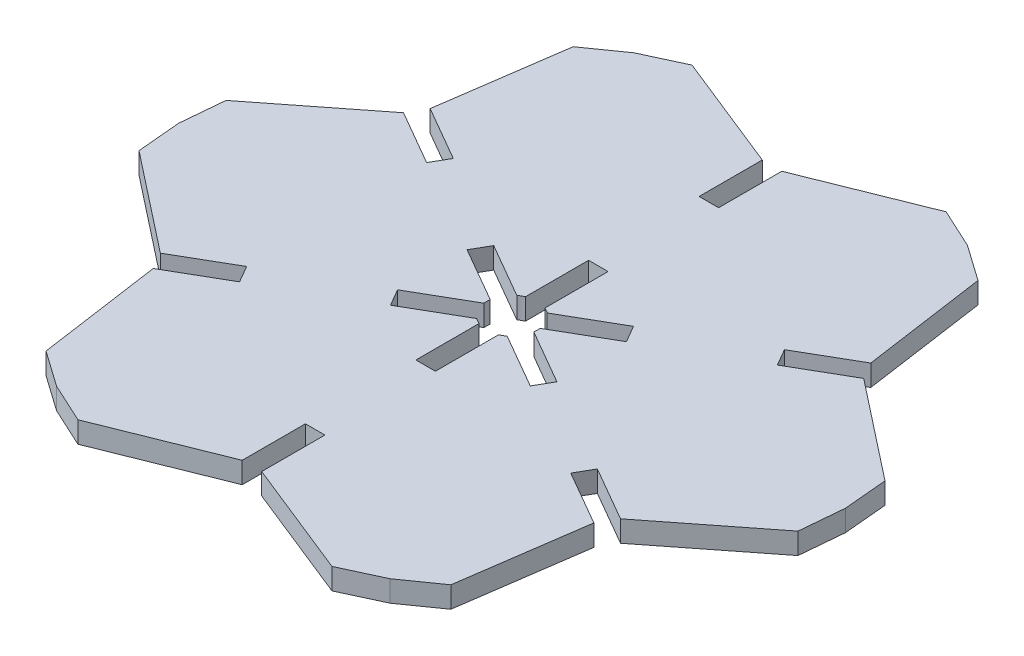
ISO-10303-21;
HEADER;
FILE_DESCRIPTION(('STEP AP214'),'2;1');
FILE_NAME('part.step','',(''),(''),'','','');
FILE_SCHEMA(('AUTOMOTIVE_DESIGN { 1 0 10303 214 1 1 1 1 }'));
ENDSEC;
DATA;
#1=APPLICATION_CONTEXT('core data for automotive mechanical design processes');
#2=APPLICATION_PROTOCOL_DEFINITION('international standard','automotive_design',2000,#1);
#3=PRODUCT_CONTEXT('',#1,'mechanical');
#4=PRODUCT('Part','Part','',(#3));
#5=PRODUCT_RELATED_PRODUCT_CATEGORY('part','',(#4));
#6=PRODUCT_DEFINITION_FORMATION('','',#4);
#7=PRODUCT_DEFINITION_CONTEXT('part definition',#1,'design');
#8=PRODUCT_DEFINITION('design','',#6,#7);
#9=PRODUCT_DEFINITION_SHAPE('','',#8);
#10=(LENGTH_UNIT() NAMED_UNIT(*) SI_UNIT(.MILLI.,.METRE.));
#11=(NAMED_UNIT(*) PLANE_ANGLE_UNIT() SI_UNIT($,.RADIAN.));
#12=(NAMED_UNIT(*) SI_UNIT($,.STERADIAN.) SOLID_ANGLE_UNIT());
#13=UNCERTAINTY_MEASURE_WITH_UNIT(LENGTH_MEASURE(1.E-05),#10,'distance_accuracy_value','');
#14=(GEOMETRIC_REPRESENTATION_CONTEXT(3) GLOBAL_UNCERTAINTY_ASSIGNED_CONTEXT((#13)) GLOBAL_UNIT_ASSIGNED_CONTEXT((#10,
#11,#12)) REPRESENTATION_CONTEXT('',''));
#15=CARTESIAN_POINT('',(0.,0.,0.));
#16=DIRECTION('',(0.,0.,1.));
#17=DIRECTION('',(1.,0.,0.));
#18=AXIS2_PLACEMENT_3D('',#15,#16,#17);
#19=CARTESIAN_POINT('',(0.,1.25,0.));
#20=DIRECTION('',(0.,-1.,0.));
#21=DIRECTION('',(0.,0.,-1.));
#22=AXIS2_PLACEMENT_3D('',#19,#20,#21);
#23=CYLINDRICAL_SURFACE('',#22,2.9625);
#24=DIRECTION('',(0.,-1.,0.));
#25=VECTOR('',#24,1.);
#26=CARTESIAN_POINT('',(1.15,1.25,2.73018428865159));
#27=LINE('',#26,#25);
#28=CARTESIAN_POINT('',(1.15,1.25,2.73018428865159));
#29=VERTEX_POINT('',#28);
#30=CARTESIAN_POINT('',(1.15,-1.25000625,2.73018428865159));
#31=VERTEX_POINT('',#30);
#32=EDGE_CURVE('E991',#29,#31,#27,.T.);
#33=ORIENTED_EDGE('',*,*,#32,.F.);
#34=CARTESIAN_POINT('',(0.,1.25,0.));
#35=DIRECTION('',(0.,1.,0.));
#36=DIRECTION('',(0.,0.,1.));
#37=AXIS2_PLACEMENT_3D('',#34,#35,#36);
#38=CIRCLE('',#37,2.9625);
#39=CARTESIAN_POINT('',(1.78940895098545,1.25,2.36102135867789));
#40=VERTEX_POINT('',#39);
#41=EDGE_CURVE('E1198',#29,#40,#38,.T.);
#42=ORIENTED_EDGE('',*,*,#41,.T.);
#43=DIRECTION('',(0.,-1.,0.));
#44=VECTOR('',#43,1.);
#45=CARTESIAN_POINT('',(1.78940895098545,1.25,2.36102135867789));
#46=LINE('',#45,#44);
#47=CARTESIAN_POINT('',(1.78940895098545,-1.25000625,2.36102135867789));
#48=VERTEX_POINT('',#47);
#49=EDGE_CURVE('E974',#48,#40,#46,.F.);
#50=ORIENTED_EDGE('',*,*,#49,.F.);
#51=CARTESIAN_POINT('',(0.,-1.25,0.));
#52=DIRECTION('',(0.,1.,0.));
#53=DIRECTION('',(0.,0.,1.));
#54=AXIS2_PLACEMENT_3D('',#51,#52,#53);
#55=CIRCLE('',#54,2.9625);
#56=EDGE_CURVE('E936',#31,#48,#55,.T.);
#57=ORIENTED_EDGE('',*,*,#56,.F.);
#58=EDGE_LOOP('',(#33,#42,#50,#57));
#59=FACE_BOUND('',#58,.T.);
#60=ADVANCED_FACE('F45',(#59),#23,.F.);
#61=DIRECTION('',(0.,-1.,0.));
#62=VECTOR('',#61,1.);
#63=CARTESIAN_POINT('',(2.93940895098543,1.25,0.369162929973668));
#64=LINE('',#63,#62);
#65=CARTESIAN_POINT('',(2.93940895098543,1.25,0.369162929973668));
#66=VERTEX_POINT('',#65);
#67=CARTESIAN_POINT('',(2.93940895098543,-1.25000625,0.369162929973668));
#68=VERTEX_POINT('',#67);
#69=EDGE_CURVE('E978',#66,#68,#64,.T.);
#70=ORIENTED_EDGE('',*,*,#69,.F.);
#71=CARTESIAN_POINT('',(2.93940895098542,1.25,-0.369162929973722));
#72=VERTEX_POINT('',#71);
#73=EDGE_CURVE('E1202',#66,#72,#38,.T.);
#74=ORIENTED_EDGE('',*,*,#73,.T.);
#75=DIRECTION('',(0.,-1.,0.));
#76=VECTOR('',#75,1.);
#77=CARTESIAN_POINT('',(2.93940895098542,1.25,-0.369162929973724));
#78=LINE('',#77,#76);
#79=CARTESIAN_POINT('',(2.93940895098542,-1.25000625,-0.369162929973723));
#80=VERTEX_POINT('',#79);
#81=EDGE_CURVE('E1190',#80,#72,#78,.F.);
#82=ORIENTED_EDGE('',*,*,#81,.F.);
#83=EDGE_CURVE('E943',#68,#80,#55,.T.);
#84=ORIENTED_EDGE('',*,*,#83,.F.);
#85=EDGE_LOOP('',(#70,#74,#82,#84));
#86=FACE_BOUND('',#85,.T.);
#87=ADVANCED_FACE('F1856',(#86),#23,.F.);
#88=DIRECTION('',(0.,-1.,0.));
#89=VECTOR('',#88,1.);
#90=CARTESIAN_POINT('',(-2.93940895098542,1.25,-0.369162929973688));
#91=LINE('',#90,#89);
#92=CARTESIAN_POINT('',(-2.93940895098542,1.25,-0.369162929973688));
#93=VERTEX_POINT('',#92);
#94=CARTESIAN_POINT('',(-2.93940895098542,-1.25000625,-0.369162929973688));
#95=VERTEX_POINT('',#94);
#96=EDGE_CURVE('E964',#93,#95,#91,.T.);
#97=ORIENTED_EDGE('',*,*,#96,.F.);
#98=CARTESIAN_POINT('',(-2.93940895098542,1.25,0.369162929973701));
#99=VERTEX_POINT('',#98);
#100=EDGE_CURVE('E1181',#93,#99,#38,.T.);
#101=ORIENTED_EDGE('',*,*,#100,.T.);
#102=DIRECTION('',(0.,-1.,0.));
#103=VECTOR('',#102,1.);
#104=CARTESIAN_POINT('',(-2.93940895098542,1.25,0.369162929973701));
#105=LINE('',#104,#103);
#106=CARTESIAN_POINT('',(-2.93940895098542,-1.25000625,0.369162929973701));
#107=VERTEX_POINT('',#106);
#108=EDGE_CURVE('E1753',#107,#99,#105,.F.);
#109=ORIENTED_EDGE('',*,*,#108,.F.);
#110=EDGE_CURVE('E951',#95,#107,#55,.T.);
#111=ORIENTED_EDGE('',*,*,#110,.F.);
#112=EDGE_LOOP('',(#97,#101,#109,#111));
#113=FACE_BOUND('',#112,.T.);
#114=ADVANCED_FACE('F1862',(#113),#23,.F.);
#115=DIRECTION('',(0.,-1.,0.));
#116=VECTOR('',#115,1.);
#117=CARTESIAN_POINT('',(-1.15,1.25,2.73018428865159));
#118=LINE('',#117,#116);
#119=CARTESIAN_POINT('',(-1.15,-1.25000625,2.73018428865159));
#120=VERTEX_POINT('',#119);
#121=CARTESIAN_POINT('',(-1.15,1.25,2.73018428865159));
#122=VERTEX_POINT('',#121);
#123=EDGE_CURVE('E984',#120,#122,#118,.F.);
#124=ORIENTED_EDGE('',*,*,#123,.F.);
#125=CARTESIAN_POINT('',(-1.78940895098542,-1.25000625,2.36102135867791));
#126=VERTEX_POINT('',#125);
#127=EDGE_CURVE('E955',#126,#120,#55,.T.);
#128=ORIENTED_EDGE('',*,*,#127,.F.);
#129=DIRECTION('',(0.,-1.,0.));
#130=VECTOR('',#129,1.);
#131=CARTESIAN_POINT('',(-1.78940895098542,1.25,2.36102135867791));
#132=LINE('',#131,#130);
#133=CARTESIAN_POINT('',(-1.78940895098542,1.25,2.36102135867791));
#134=VERTEX_POINT('',#133);
#135=EDGE_CURVE('E965',#134,#126,#132,.T.);
#136=ORIENTED_EDGE('',*,*,#135,.F.);
#137=EDGE_CURVE('E1194',#134,#122,#38,.T.);
#138=ORIENTED_EDGE('',*,*,#137,.T.);
#139=EDGE_LOOP('',(#124,#128,#136,#138));
#140=FACE_BOUND('',#139,.T.);
#141=ADVANCED_FACE('F1832',(#140),#23,.F.);
#142=DIRECTION('',(0.,-1.,0.));
#143=VECTOR('',#142,1.);
#144=CARTESIAN_POINT('',(1.78940895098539,1.25,-2.36102135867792));
#145=LINE('',#144,#143);
#146=CARTESIAN_POINT('',(1.78940895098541,1.25,-2.36102135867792));
#147=VERTEX_POINT('',#146);
#148=CARTESIAN_POINT('',(1.78940895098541,-1.25000625,-2.36102135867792));
#149=VERTEX_POINT('',#148);
#150=EDGE_CURVE('E1291',#147,#149,#145,.T.);
#151=ORIENTED_EDGE('',*,*,#150,.F.);
#152=CARTESIAN_POINT('',(1.15,1.25,-2.73018428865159));
#153=VERTEX_POINT('',#152);
#154=EDGE_CURVE('E971',#147,#153,#38,.T.);
#155=ORIENTED_EDGE('',*,*,#154,.T.);
#156=DIRECTION('',(0.,1.,0.));
#157=VECTOR('',#156,1.);
#158=CARTESIAN_POINT('',(1.15,-1.25,-2.73018428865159));
#159=LINE('',#158,#157);
#160=CARTESIAN_POINT('',(1.15,-1.25,-2.73018428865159));
#161=VERTEX_POINT('',#160);
#162=EDGE_CURVE('E876',#161,#153,#159,.T.);
#163=ORIENTED_EDGE('',*,*,#162,.F.);
#164=EDGE_CURVE('E928',#149,#161,#55,.T.);
#165=ORIENTED_EDGE('',*,*,#164,.F.);
#166=EDGE_LOOP('',(#151,#155,#163,#165));
#167=FACE_BOUND('',#166,.T.);
#168=ADVANCED_FACE('F1289',(#167),#23,.F.);
#169=CARTESIAN_POINT('',(0.,1.25,0.));
#170=DIRECTION('',(0.,1.,0.));
#171=DIRECTION('',(0.,0.,1.));
#172=AXIS2_PLACEMENT_3D('',#169,#170,#171);
#173=PLANE('',#172);
#174=DIRECTION('',(0.,0.,-1.));
#175=VECTOR('',#174,1.);
#176=CARTESIAN_POINT('',(1.15,1.25,0.));
#177=LINE('',#176,#175);
#178=CARTESIAN_POINT('',(1.15,1.25,10.1822184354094));
#179=VERTEX_POINT('',#178);
#180=EDGE_CURVE('E582',#179,#29,#177,.T.);
#181=ORIENTED_EDGE('',*,*,#180,.F.);
#182=DIRECTION('',(1.,0.,0.));
#183=VECTOR('',#182,1.);
#184=CARTESIAN_POINT('',(0.,1.25,10.1822184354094));
#185=LINE('',#184,#183);
#186=CARTESIAN_POINT('',(-1.15,1.25,10.1822184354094));
#187=VERTEX_POINT('',#186);
#188=EDGE_CURVE('E527',#187,#179,#185,.T.);
#189=ORIENTED_EDGE('',*,*,#188,.F.);
#190=DIRECTION('',(0.,0.,1.));
#191=VECTOR('',#190,1.);
#192=CARTESIAN_POINT('',(-1.15,1.25,0.));
#193=LINE('',#192,#191);
#194=EDGE_CURVE('E576',#122,#187,#193,.T.);
#195=ORIENTED_EDGE('',*,*,#194,.F.);
#196=ORIENTED_EDGE('',*,*,#137,.F.);
#197=DIRECTION('',(0.866025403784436,0.,-0.500000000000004));
#198=VECTOR('',#197,1.);
#199=CARTESIAN_POINT('',(0.575000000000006,1.25,0.995929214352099));
#200=LINE('',#199,#198);
#201=CARTESIAN_POINT('',(-8.24305983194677,1.25,6.08703843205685));
#202=VERTEX_POINT('',#201);
#203=EDGE_CURVE('E553',#202,#134,#200,.T.);
#204=ORIENTED_EDGE('',*,*,#203,.F.);
#205=DIRECTION('',(0.500000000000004,0.,0.866025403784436));
#206=VECTOR('',#205,1.);
#207=CARTESIAN_POINT('',(-8.81805983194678,1.25,5.09110921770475));
#208=LINE('',#207,#206);
#209=CARTESIAN_POINT('',(-9.39305983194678,1.25,4.09518000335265));
#210=VERTEX_POINT('',#209);
#211=EDGE_CURVE('E834',#210,#202,#208,.T.);
#212=ORIENTED_EDGE('',*,*,#211,.F.);
#213=DIRECTION('',(-0.866025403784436,0.,0.500000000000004));
#214=VECTOR('',#213,1.);
#215=CARTESIAN_POINT('',(-0.575000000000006,1.25,-0.995929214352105));
#216=LINE('',#215,#214);
#217=EDGE_CURVE('E537',#99,#210,#216,.T.);
#218=ORIENTED_EDGE('',*,*,#217,.F.);
#219=ORIENTED_EDGE('',*,*,#100,.F.);
#220=DIRECTION('',(0.86602540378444,0.,0.499999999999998));
#221=VECTOR('',#220,1.);
#222=CARTESIAN_POINT('',(-0.574999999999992,1.25,0.995929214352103));
#223=LINE('',#222,#221);
#224=CARTESIAN_POINT('',(-9.39305983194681,1.25,-4.09518000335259));
#225=VERTEX_POINT('',#224);
#226=EDGE_CURVE('E558',#225,#93,#223,.T.);
#227=ORIENTED_EDGE('',*,*,#226,.F.);
#228=DIRECTION('',(-0.499999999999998,0.,0.86602540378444));
#229=VECTOR('',#228,1.);
#230=CARTESIAN_POINT('',(-8.81805983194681,1.25,-5.09110921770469));
#231=LINE('',#230,#229);
#232=CARTESIAN_POINT('',(-8.24305983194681,1.25,-6.0870384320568));
#233=VERTEX_POINT('',#232);
#234=EDGE_CURVE('E837',#233,#225,#231,.T.);
#235=ORIENTED_EDGE('',*,*,#234,.F.);
#236=DIRECTION('',(-0.86602540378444,0.,-0.499999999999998));
#237=VECTOR('',#236,1.);
#238=CARTESIAN_POINT('',(0.575000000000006,1.25,-0.99592921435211));
#239=LINE('',#238,#237);
#240=CARTESIAN_POINT('',(-1.78940895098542,1.25,-2.3610213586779));
#241=VERTEX_POINT('',#240);
#242=EDGE_CURVE('E552',#241,#233,#239,.T.);
#243=ORIENTED_EDGE('',*,*,#242,.F.);
#244=CARTESIAN_POINT('',(-1.15,1.250006,-2.7301842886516));
#245=VERTEX_POINT('',#244);
#246=EDGE_CURVE('E1173',#245,#241,#38,.T.);
#247=ORIENTED_EDGE('',*,*,#246,.F.);
#248=DIRECTION('',(0.,0.,1.));
#249=VECTOR('',#248,1.);
#250=CARTESIAN_POINT('',(-1.15,1.25,0.));
#251=LINE('',#250,#249);
#252=CARTESIAN_POINT('',(-1.15,1.25,-10.1822184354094));
#253=VERTEX_POINT('',#252);
#254=EDGE_CURVE('E893',#253,#245,#251,.T.);
#255=ORIENTED_EDGE('',*,*,#254,.F.);
#256=DIRECTION('',(-1.,0.,0.));
#257=VECTOR('',#256,1.);
#258=CARTESIAN_POINT('',(0.,1.25,-10.1822184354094));
#259=LINE('',#258,#257);
#260=CARTESIAN_POINT('',(1.15,1.25,-10.1822184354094));
#261=VERTEX_POINT('',#260);
#262=EDGE_CURVE('E916',#261,#253,#259,.T.);
#263=ORIENTED_EDGE('',*,*,#262,.F.);
#264=DIRECTION('',(0.,0.,-1.));
#265=VECTOR('',#264,1.);
#266=CARTESIAN_POINT('',(1.15,1.25,0.));
#267=LINE('',#266,#265);
#268=EDGE_CURVE('E890',#153,#261,#267,.T.);
#269=ORIENTED_EDGE('',*,*,#268,.F.);
#270=ORIENTED_EDGE('',*,*,#154,.F.);
#271=DIRECTION('',(-0.866025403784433,0.,0.50000000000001));
#272=VECTOR('',#271,1.);
#273=CARTESIAN_POINT('',(-0.575000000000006,1.25,-0.995929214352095));
#274=LINE('',#273,#272);
#275=CARTESIAN_POINT('',(8.24305983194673,1.25,-6.08703843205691));
#276=VERTEX_POINT('',#275);
#277=EDGE_CURVE('E532',#276,#147,#274,.T.);
#278=ORIENTED_EDGE('',*,*,#277,.F.);
#279=DIRECTION('',(-0.50000000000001,0.,-0.866025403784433));
#280=VECTOR('',#279,1.);
#281=CARTESIAN_POINT('',(8.81805983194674,1.25,-5.09110921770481));
#282=LINE('',#281,#280);
#283=CARTESIAN_POINT('',(9.39305983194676,1.25,-4.09518000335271));
#284=VERTEX_POINT('',#283);
#285=EDGE_CURVE('E831',#284,#276,#282,.T.);
#286=ORIENTED_EDGE('',*,*,#285,.F.);
#287=DIRECTION('',(0.866025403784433,0.,-0.50000000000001));
#288=VECTOR('',#287,1.);
#289=CARTESIAN_POINT('',(0.575000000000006,1.25,0.9959292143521));
#290=LINE('',#289,#288);
#291=EDGE_CURVE('E525',#72,#284,#290,.T.);
#292=ORIENTED_EDGE('',*,*,#291,.F.);
#293=ORIENTED_EDGE('',*,*,#73,.F.);
#294=DIRECTION('',(-0.866025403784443,0.,-0.499999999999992));
#295=VECTOR('',#294,1.);
#296=CARTESIAN_POINT('',(0.574999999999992,1.25,-0.995929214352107));
#297=LINE('',#296,#295);
#298=CARTESIAN_POINT('',(9.39305983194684,1.25,4.09518000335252));
#299=VERTEX_POINT('',#298);
#300=EDGE_CURVE('E577',#299,#66,#297,.T.);
#301=ORIENTED_EDGE('',*,*,#300,.F.);
#302=DIRECTION('',(0.499999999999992,0.,-0.866025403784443));
#303=VECTOR('',#302,1.);
#304=CARTESIAN_POINT('',(8.81805983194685,1.25,5.09110921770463));
#305=LINE('',#304,#303);
#306=CARTESIAN_POINT('',(8.24305983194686,1.25,6.08703843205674));
#307=VERTEX_POINT('',#306);
#308=EDGE_CURVE('E839',#307,#299,#305,.T.);
#309=ORIENTED_EDGE('',*,*,#308,.F.);
#310=DIRECTION('',(0.866025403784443,0.,0.499999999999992));
#311=VECTOR('',#310,1.);
#312=CARTESIAN_POINT('',(-0.574999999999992,1.25,0.995929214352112));
#313=LINE('',#312,#311);
#314=EDGE_CURVE('E561',#40,#307,#313,.T.);
#315=ORIENTED_EDGE('',*,*,#314,.F.);
#316=ORIENTED_EDGE('',*,*,#41,.F.);
#317=EDGE_LOOP('',(#181,#189,#195,#196,#204,#212,#218,#219,#227,#235,#243,#247,#255,#263,#269,
#270,#278,#286,#292,#293,#301,#309,#315,#316));
#318=FACE_BOUND('',#317,.T.);
#319=DIRECTION('',(0.907408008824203,0.,-0.420250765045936));
#320=VECTOR('',#319,1.);
#321=CARTESIAN_POINT('',(-16.4543143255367,1.25,-35.5282556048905));
#322=LINE('',#321,#320);
#323=CARTESIAN_POINT('',(-19.6561175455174,1.25,-34.0453942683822));
#324=VERTEX_POINT('',#323);
#325=CARTESIAN_POINT('',(-14.980570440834,1.25,-36.210795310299));
#326=VERTEX_POINT('',#325);
#327=EDGE_CURVE('E695',#324,#326,#322,.T.);
#328=ORIENTED_EDGE('',*,*,#327,.F.);
#329=DIRECTION('',(0.817651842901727,0.,-0.575713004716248));
#330=VECTOR('',#329,1.);
#331=CARTESIAN_POINT('',(-22.5412147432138,1.25,-32.0139820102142));
#332=LINE('',#331,#330);
#333=CARTESIAN_POINT('',(-23.8691834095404,1.25,-31.0789522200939));
#334=VERTEX_POINT('',#333);
#335=EDGE_CURVE('E899',#334,#324,#332,.T.);
#336=ORIENTED_EDGE('',*,*,#335,.F.);
#337=DIRECTION('',(0.141668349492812,0.,-0.989914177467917));
#338=VECTOR('',#337,1.);
#339=CARTESIAN_POINT('',(-27.748627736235,1.25,-3.97115465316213));
#340=LINE('',#339,#338);
#341=CARTESIAN_POINT('',(-25.9802719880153,1.25,-16.3276226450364));
#342=VERTEX_POINT('',#341);
#343=EDGE_CURVE('E476',#342,#334,#340,.T.);
#344=ORIENTED_EDGE('',*,*,#343,.F.);
#345=DIRECTION('',(-0.86602540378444,0.,-0.499999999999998));
#346=VECTOR('',#345,1.);
#347=CARTESIAN_POINT('',(0.574999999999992,1.25,-0.995929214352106));
#348=LINE('',#347,#346);
#349=CARTESIAN_POINT('',(-19.5266211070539,1.25,-12.6016055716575));
#350=VERTEX_POINT('',#349);
#351=EDGE_CURVE('E484',#350,#342,#348,.T.);
#352=ORIENTED_EDGE('',*,*,#351,.F.);
#353=DIRECTION('',(0.499999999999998,0.,-0.86602540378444));
#354=VECTOR('',#353,1.);
#355=CARTESIAN_POINT('',(-20.1016211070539,1.25,-11.6056763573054));
#356=LINE('',#355,#354);
#357=CARTESIAN_POINT('',(-20.6766211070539,1.25,-10.6097471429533));
#358=VERTEX_POINT('',#357);
#359=EDGE_CURVE('E826',#358,#350,#356,.T.);
#360=ORIENTED_EDGE('',*,*,#359,.F.);
#361=DIRECTION('',(0.86602540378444,0.,0.499999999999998));
#362=VECTOR('',#361,1.);
#363=CARTESIAN_POINT('',(-0.574999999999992,1.25,0.995929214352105));
#364=LINE('',#363,#362);
#365=CARTESIAN_POINT('',(-27.1302719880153,1.25,-14.3357642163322));
#366=VERTEX_POINT('',#365);
#367=EDGE_CURVE('E823',#366,#358,#364,.T.);
#368=ORIENTED_EDGE('',*,*,#367,.F.);
#369=DIRECTION('',(0.786456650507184,0.,-0.617645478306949));
#370=VECTOR('',#369,1.);
#371=CARTESIAN_POINT('',(-17.3134346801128,1.25,-22.0454392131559));
#372=LINE('',#371,#370);
#373=CARTESIAN_POINT('',(-38.8497538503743,1.25,-5.13184309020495));
#374=VERTEX_POINT('',#373);
#375=EDGE_CURVE('E820',#374,#366,#372,.T.);
#376=ORIENTED_EDGE('',*,*,#375,.F.);
#377=DIRECTION('',(0.0897561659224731,0.,-0.995963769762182));
#378=VECTOR('',#377,1.);
#379=CARTESIAN_POINT('',(-38.9955290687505,1.25,-3.51427359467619));
#380=LINE('',#379,#378);
#381=CARTESIAN_POINT('',(-39.3122350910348,1.25,1.18828558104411E-13));
#382=VERTEX_POINT('',#381);
#383=EDGE_CURVE('E814',#382,#374,#380,.T.);
#384=ORIENTED_EDGE('',*,*,#383,.F.);
#385=DIRECTION('',(-0.08975616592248,0.,-0.995963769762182));
#386=VECTOR('',#385,1.);
#387=CARTESIAN_POINT('',(-38.9955290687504,1.25,3.51427359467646));
#388=LINE('',#387,#386);
#389=CARTESIAN_POINT('',(-38.8497538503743,1.25,5.13184309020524));
#390=VERTEX_POINT('',#389);
#391=EDGE_CURVE('E817',#390,#382,#388,.T.);
#392=ORIENTED_EDGE('',*,*,#391,.F.);
#393=DIRECTION('',(-0.786456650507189,0.,-0.617645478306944));
#394=VECTOR('',#393,1.);
#395=CARTESIAN_POINT('',(-17.3134346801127,1.25,22.045439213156));
#396=LINE('',#395,#394);
#397=CARTESIAN_POINT('',(-27.1302719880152,1.25,14.3357642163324));
#398=VERTEX_POINT('',#397);
#399=EDGE_CURVE('E811',#398,#390,#396,.T.);
#400=ORIENTED_EDGE('',*,*,#399,.F.);
#401=DIRECTION('',(-0.866025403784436,0.,0.500000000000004));
#402=VECTOR('',#401,1.);
#403=CARTESIAN_POINT('',(-0.575000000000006,1.25,-0.995929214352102));
#404=LINE('',#403,#402);
#405=CARTESIAN_POINT('',(-20.6766211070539,1.25,10.6097471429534));
#406=VERTEX_POINT('',#405);
#407=EDGE_CURVE('E808',#406,#398,#404,.T.);
#408=ORIENTED_EDGE('',*,*,#407,.F.);
#409=DIRECTION('',(-0.500000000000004,0.,-0.866025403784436));
#410=VECTOR('',#409,1.);
#411=CARTESIAN_POINT('',(-20.1016211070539,1.25,11.6056763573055));
#412=LINE('',#411,#410);
#413=CARTESIAN_POINT('',(-19.5266211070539,1.25,12.6016055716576));
#414=VERTEX_POINT('',#413);
#415=EDGE_CURVE('E805',#414,#406,#412,.T.);
#416=ORIENTED_EDGE('',*,*,#415,.F.);
#417=DIRECTION('',(0.866025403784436,0.,-0.500000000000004));
#418=VECTOR('',#417,1.);
#419=CARTESIAN_POINT('',(0.575000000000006,1.25,0.995929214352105));
#420=LINE('',#419,#418);
#421=CARTESIAN_POINT('',(-25.9802719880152,1.25,16.3276226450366));
#422=VERTEX_POINT('',#421);
#423=EDGE_CURVE('E802',#422,#414,#420,.T.);
#424=ORIENTED_EDGE('',*,*,#423,.F.);
#425=DIRECTION('',(-0.141668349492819,0.,-0.989914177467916));
#426=VECTOR('',#425,1.);
#427=CARTESIAN_POINT('',(-27.748627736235,1.25,3.97115465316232));
#428=LINE('',#427,#426);
#429=CARTESIAN_POINT('',(-23.8691834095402,1.25,31.078952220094));
#430=VERTEX_POINT('',#429);
#431=EDGE_CURVE('E799',#430,#422,#428,.T.);
#432=ORIENTED_EDGE('',*,*,#431,.F.);
#433=DIRECTION('',(-0.817651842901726,0.,-0.575713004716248));
#434=VECTOR('',#433,1.);
#435=CARTESIAN_POINT('',(-22.5412147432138,1.25,32.0139820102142));
#436=LINE('',#435,#434);
#437=CARTESIAN_POINT('',(-19.6561175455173,1.25,34.0453942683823));
#438=VERTEX_POINT('',#437);
#439=EDGE_CURVE('E793',#438,#430,#436,.T.);
#440=ORIENTED_EDGE('',*,*,#439,.F.);
#441=DIRECTION('',(-0.907408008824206,0.,-0.42025076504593));
#442=VECTOR('',#441,1.);
#443=CARTESIAN_POINT('',(-16.4543143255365,1.25,35.5282556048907));
#444=LINE('',#443,#442);
#445=CARTESIAN_POINT('',(-14.9805704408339,1.25,36.210795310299));
#446=VERTEX_POINT('',#445);
#447=EDGE_CURVE('E796',#446,#438,#444,.T.);
#448=ORIENTED_EDGE('',*,*,#447,.F.);
#449=DIRECTION('',(-0.928125,0.,0.372268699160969));
#450=VECTOR('',#449,1.);
#451=CARTESIAN_POINT('',(10.4351930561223,1.25,26.0165938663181));
#452=LINE('',#451,#450);
#453=CARTESIAN_POINT('',(-1.15,1.25,30.6633868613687));
#454=VERTEX_POINT('',#453);
#455=EDGE_CURVE('E790',#454,#446,#452,.T.);
#456=ORIENTED_EDGE('',*,*,#455,.F.);
#457=DIRECTION('',(0.,0.,1.));
#458=VECTOR('',#457,1.);
#459=CARTESIAN_POINT('',(-1.15,1.25,0.));
#460=LINE('',#459,#458);
#461=CARTESIAN_POINT('',(-1.15,1.25,23.2113527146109));
#462=VERTEX_POINT('',#461);
#463=EDGE_CURVE('E787',#462,#454,#460,.T.);
#464=ORIENTED_EDGE('',*,*,#463,.F.);
#465=DIRECTION('',(-1.,0.,0.));
#466=VECTOR('',#465,1.);
#467=CARTESIAN_POINT('',(0.,1.25,23.2113527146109));
#468=LINE('',#467,#466);
#469=CARTESIAN_POINT('',(1.15,1.25,23.2113527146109));
#470=VERTEX_POINT('',#469);
#471=EDGE_CURVE('E784',#470,#462,#468,.T.);
#472=ORIENTED_EDGE('',*,*,#471,.F.);
#473=DIRECTION('',(0.,0.,-1.));
#474=VECTOR('',#473,1.);
#475=CARTESIAN_POINT('',(1.15,1.25,0.));
#476=LINE('',#475,#474);
#477=CARTESIAN_POINT('',(1.15,1.25,30.6633868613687));
#478=VERTEX_POINT('',#477);
#479=EDGE_CURVE('E781',#478,#470,#476,.T.);
#480=ORIENTED_EDGE('',*,*,#479,.F.);
#481=DIRECTION('',(-0.928125,0.,-0.372268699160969));
#482=VECTOR('',#481,1.);
#483=CARTESIAN_POINT('',(-10.4351930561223,1.25,26.0165938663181));
#484=LINE('',#483,#482);
#485=CARTESIAN_POINT('',(14.980570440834,1.25,36.210795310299));
#486=VERTEX_POINT('',#485);
#487=EDGE_CURVE('E778',#486,#478,#484,.T.);
#488=ORIENTED_EDGE('',*,*,#487,.F.);
#489=DIRECTION('',(-0.9074080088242,0.,0.420250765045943));
#490=VECTOR('',#489,1.);
#491=CARTESIAN_POINT('',(16.454314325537,1.25,35.5282556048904));
#492=LINE('',#491,#490);
#493=CARTESIAN_POINT('',(19.6561175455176,1.25,34.0453942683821));
#494=VERTEX_POINT('',#493);
#495=EDGE_CURVE('E772',#494,#486,#492,.T.);
#496=ORIENTED_EDGE('',*,*,#495,.F.);
#497=DIRECTION('',(-0.817651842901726,0.,0.575713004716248));
#498=VECTOR('',#497,1.);
#499=CARTESIAN_POINT('',(22.5412147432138,1.25,32.0139820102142));
#500=LINE('',#499,#498);
#501=CARTESIAN_POINT('',(23.8691834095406,1.25,31.0789522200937));
#502=VERTEX_POINT('',#501);
#503=EDGE_CURVE('E775',#502,#494,#500,.T.);
#504=ORIENTED_EDGE('',*,*,#503,.F.);
#505=DIRECTION('',(-0.141668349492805,0.,0.989914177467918));
#506=VECTOR('',#505,1.);
#507=CARTESIAN_POINT('',(27.7486277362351,1.25,3.97115465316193));
#508=LINE('',#507,#506);
#509=CARTESIAN_POINT('',(25.9802719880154,1.25,16.3276226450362));
#510=VERTEX_POINT('',#509);
#511=EDGE_CURVE('E769',#510,#502,#508,.T.);
#512=ORIENTED_EDGE('',*,*,#511,.F.);
#513=DIRECTION('',(0.866025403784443,0.,0.499999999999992));
#514=VECTOR('',#513,1.);
#515=CARTESIAN_POINT('',(-0.574999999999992,1.25,0.995929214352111));
#516=LINE('',#515,#514);
#517=CARTESIAN_POINT('',(19.526621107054,1.25,12.6016055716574));
#518=VERTEX_POINT('',#517);
#519=EDGE_CURVE('E766',#518,#510,#516,.T.);
#520=ORIENTED_EDGE('',*,*,#519,.F.);
#521=DIRECTION('',(-0.499999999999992,0.,0.866025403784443));
#522=VECTOR('',#521,1.);
#523=CARTESIAN_POINT('',(20.101621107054,1.25,11.6056763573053));
#524=LINE('',#523,#522);
#525=CARTESIAN_POINT('',(20.676621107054,1.25,10.6097471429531));
#526=VERTEX_POINT('',#525);
#527=EDGE_CURVE('E763',#526,#518,#524,.T.);
#528=ORIENTED_EDGE('',*,*,#527,.F.);
#529=DIRECTION('',(-0.866025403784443,0.,-0.499999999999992));
#530=VECTOR('',#529,1.);
#531=CARTESIAN_POINT('',(0.574999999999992,1.25,-0.99592921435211));
#532=LINE('',#531,#530);
#533=CARTESIAN_POINT('',(27.1302719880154,1.25,14.335764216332));
#534=VERTEX_POINT('',#533);
#535=EDGE_CURVE('E760',#534,#526,#532,.T.);
#536=ORIENTED_EDGE('',*,*,#535,.F.);
#537=DIRECTION('',(-0.78645665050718,0.,0.617645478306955));
#538=VECTOR('',#537,1.);
#539=CARTESIAN_POINT('',(17.313434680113,1.25,22.0454392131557));
#540=LINE('',#539,#538);
#541=CARTESIAN_POINT('',(38.8497538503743,1.25,5.13184309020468));
#542=VERTEX_POINT('',#541);
#543=EDGE_CURVE('E757',#542,#534,#540,.T.);
#544=ORIENTED_EDGE('',*,*,#543,.F.);
#545=DIRECTION('',(-0.0897561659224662,0.,0.995963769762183));
#546=VECTOR('',#545,1.);
#547=CARTESIAN_POINT('',(38.9955290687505,1.25,3.51427359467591));
#548=LINE('',#547,#546);
#549=CARTESIAN_POINT('',(39.3122350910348,1.25,-3.94649590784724E-13));
#550=VERTEX_POINT('',#549);
#551=EDGE_CURVE('E751',#550,#542,#548,.T.);
#552=ORIENTED_EDGE('',*,*,#551,.F.);
#553=DIRECTION('',(0.089756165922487,0.,0.995963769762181));
#554=VECTOR('',#553,1.);
#555=CARTESIAN_POINT('',(38.9955290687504,1.25,-3.51427359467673));
#556=LINE('',#555,#554);
#557=CARTESIAN_POINT('',(38.8497538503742,1.25,-5.1318430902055));
#558=VERTEX_POINT('',#557);
#559=EDGE_CURVE('E754',#558,#550,#556,.T.);
#560=ORIENTED_EDGE('',*,*,#559,.F.);
#561=DIRECTION('',(0.786456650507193,0.,0.617645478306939));
#562=VECTOR('',#561,1.);
#563=CARTESIAN_POINT('',(17.3134346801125,1.25,-22.0454392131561));
#564=LINE('',#563,#562);
#565=CARTESIAN_POINT('',(27.1302719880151,1.25,-14.3357642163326));
#566=VERTEX_POINT('',#565);
#567=EDGE_CURVE('E748',#566,#558,#564,.T.);
#568=ORIENTED_EDGE('',*,*,#567,.F.);
#569=DIRECTION('',(0.866025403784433,0.,-0.50000000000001));
#570=VECTOR('',#569,1.);
#571=CARTESIAN_POINT('',(0.575000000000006,1.25,0.995929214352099));
#572=LINE('',#571,#570);
#573=CARTESIAN_POINT('',(20.6766211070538,1.25,-10.6097471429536));
#574=VERTEX_POINT('',#573);
#575=EDGE_CURVE('E745',#574,#566,#572,.T.);
#576=ORIENTED_EDGE('',*,*,#575,.F.);
#577=DIRECTION('',(0.50000000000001,0.,0.866025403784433));
#578=VECTOR('',#577,1.);
#579=CARTESIAN_POINT('',(20.1016211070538,1.25,-11.6056763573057));
#580=LINE('',#579,#578);
#581=CARTESIAN_POINT('',(19.5266211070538,1.25,-12.6016055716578));
#582=VERTEX_POINT('',#581);
#583=EDGE_CURVE('E742',#582,#574,#580,.T.);
#584=ORIENTED_EDGE('',*,*,#583,.F.);
#585=DIRECTION('',(-0.866025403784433,0.,0.50000000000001));
#586=VECTOR('',#585,1.);
#587=CARTESIAN_POINT('',(-0.575000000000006,1.25,-0.995929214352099));
#588=LINE('',#587,#586);
#589=CARTESIAN_POINT('',(25.9802719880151,1.25,-16.3276226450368));
#590=VERTEX_POINT('',#589);
#591=EDGE_CURVE('E739',#590,#582,#588,.T.);
#592=ORIENTED_EDGE('',*,*,#591,.F.);
#593=DIRECTION('',(0.141668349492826,0.,0.989914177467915));
#594=VECTOR('',#593,1.);
#595=CARTESIAN_POINT('',(27.748627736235,1.25,-3.97115465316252));
#596=LINE('',#595,#594);
#597=CARTESIAN_POINT('',(23.86918340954,1.25,-31.0789522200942));
#598=VERTEX_POINT('',#597);
#599=EDGE_CURVE('E526',#598,#590,#596,.T.);
#600=ORIENTED_EDGE('',*,*,#599,.F.);
#601=DIRECTION('',(0.817651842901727,0.,0.575713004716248));
#602=VECTOR('',#601,1.);
#603=CARTESIAN_POINT('',(22.5412147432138,1.25,-32.0139820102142));
#604=LINE('',#603,#602);
#605=CARTESIAN_POINT('',(19.6561175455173,1.25,-34.0453942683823));
#606=VERTEX_POINT('',#605);
#607=EDGE_CURVE('E912',#606,#598,#604,.T.);
#608=ORIENTED_EDGE('',*,*,#607,.F.);
#609=DIRECTION('',(0.907408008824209,0.,0.420250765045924));
#610=VECTOR('',#609,1.);
#611=CARTESIAN_POINT('',(16.4543143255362,1.25,-35.5282556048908));
#612=LINE('',#611,#610);
#613=CARTESIAN_POINT('',(14.9805704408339,1.25,-36.210795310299));
#614=VERTEX_POINT('',#613);
#615=EDGE_CURVE('E706',#614,#606,#612,.T.);
#616=ORIENTED_EDGE('',*,*,#615,.F.);
#617=DIRECTION('',(0.928125,0.,-0.372268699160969));
#618=VECTOR('',#617,1.);
#619=CARTESIAN_POINT('',(-10.4351930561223,1.25,-26.0165938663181));
#620=LINE('',#619,#618);
#621=CARTESIAN_POINT('',(1.15,1.25,-30.6633868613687));
#622=VERTEX_POINT('',#621);
#623=EDGE_CURVE('E908',#622,#614,#620,.T.);
#624=ORIENTED_EDGE('',*,*,#623,.F.);
#625=DIRECTION('',(0.,0.,-1.));
#626=VECTOR('',#625,1.);
#627=CARTESIAN_POINT('',(1.15,1.25,0.));
#628=LINE('',#627,#626);
#629=CARTESIAN_POINT('',(1.15,1.25,-23.2113527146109));
#630=VERTEX_POINT('',#629);
#631=EDGE_CURVE('E925',#630,#622,#628,.T.);
#632=ORIENTED_EDGE('',*,*,#631,.F.);
#633=DIRECTION('',(1.,0.,0.));
#634=VECTOR('',#633,1.);
#635=CARTESIAN_POINT('',(0.,1.25,-23.2113527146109));
#636=LINE('',#635,#634);
#637=CARTESIAN_POINT('',(-1.15,1.25,-23.2113527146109));
#638=VERTEX_POINT('',#637);
#639=EDGE_CURVE('E922',#638,#630,#636,.T.);
#640=ORIENTED_EDGE('',*,*,#639,.F.);
#641=DIRECTION('',(0.,0.,1.));
#642=VECTOR('',#641,1.);
#643=CARTESIAN_POINT('',(-1.15,1.25,0.));
#644=LINE('',#643,#642);
#645=CARTESIAN_POINT('',(-1.15,1.25,-30.6633868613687));
#646=VERTEX_POINT('',#645);
#647=EDGE_CURVE('E919',#646,#638,#644,.T.);
#648=ORIENTED_EDGE('',*,*,#647,.F.);
#649=DIRECTION('',(0.928125,0.,0.372268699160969));
#650=VECTOR('',#649,1.);
#651=CARTESIAN_POINT('',(10.4351930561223,1.25,-26.0165938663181));
#652=LINE('',#651,#650);
#653=EDGE_CURVE('E905',#326,#646,#652,.T.);
#654=ORIENTED_EDGE('',*,*,#653,.F.);
#655=EDGE_LOOP('',(#328,#336,#344,#352,#360,#368,#376,#384,#392,#400,#408,#416,#424,#432,#440,
#448,#456,#464,#472,#480,#488,#496,#504,#512,#520,#528,#536,#544,#552,#560,#568,#576,#584,#592,
#600,#608,#616,#624,#632,#640,#648,#654));
#656=FACE_BOUND('',#655,.T.);
#657=ADVANCED_FACE('F1150',(#318,#656),#173,.T.);
#658=CARTESIAN_POINT('',(0.,-1.25,0.));
#659=DIRECTION('',(0.,1.,0.));
#660=DIRECTION('',(0.,0.,1.));
#661=AXIS2_PLACEMENT_3D('',#658,#659,#660);
#662=PLANE('',#661);
#663=DIRECTION('',(0.817651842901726,0.,-0.575713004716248));
#664=VECTOR('',#663,1.);
#665=CARTESIAN_POINT('',(-16.,-1.25,-36.6196860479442));
#666=LINE('',#665,#664);
#667=CARTESIAN_POINT('',(-23.8691834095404,-1.25,-31.0789522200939));
#668=VERTEX_POINT('',#667);
#669=CARTESIAN_POINT('',(-19.6561175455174,-1.25,-34.0453942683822));
#670=VERTEX_POINT('',#669);
#671=EDGE_CURVE('E671',#668,#670,#666,.T.);
#672=ORIENTED_EDGE('',*,*,#671,.T.);
#673=DIRECTION('',(0.907408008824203,0.,-0.420250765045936));
#674=VECTOR('',#673,1.);
#675=CARTESIAN_POINT('',(-16.4543143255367,-1.25,-35.5282556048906));
#676=LINE('',#675,#674);
#677=CARTESIAN_POINT('',(-14.9805704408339,-1.25,-36.210795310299));
#678=VERTEX_POINT('',#677);
#679=EDGE_CURVE('E691',#670,#678,#676,.T.);
#680=ORIENTED_EDGE('',*,*,#679,.T.);
#681=DIRECTION('',(0.928125,0.,0.372268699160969));
#682=VECTOR('',#681,1.);
#683=CARTESIAN_POINT('',(-16.,-1.25,-36.6196860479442));
#684=LINE('',#683,#682);
#685=CARTESIAN_POINT('',(-1.15,-1.25,-30.6633868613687));
#686=VERTEX_POINT('',#685);
#687=EDGE_CURVE('E1335',#678,#686,#684,.T.);
#688=ORIENTED_EDGE('',*,*,#687,.T.);
#689=DIRECTION('',(0.,0.,1.));
#690=VECTOR('',#689,1.);
#691=CARTESIAN_POINT('',(-1.15,-1.25,-30.6633868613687));
#692=LINE('',#691,#690);
#693=CARTESIAN_POINT('',(-1.15,-1.25,-23.2113527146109));
#694=VERTEX_POINT('',#693);
#695=EDGE_CURVE('E1332',#686,#694,#692,.T.);
#696=ORIENTED_EDGE('',*,*,#695,.T.);
#697=DIRECTION('',(1.,0.,0.));
#698=VECTOR('',#697,1.);
#699=CARTESIAN_POINT('',(-1.15,-1.25,-23.2113527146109));
#700=LINE('',#699,#698);
#701=CARTESIAN_POINT('',(1.15,-1.25,-23.2113527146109));
#702=VERTEX_POINT('',#701);
#703=EDGE_CURVE('E1328',#694,#702,#700,.T.);
#704=ORIENTED_EDGE('',*,*,#703,.T.);
#705=DIRECTION('',(0.,0.,-1.));
#706=VECTOR('',#705,1.);
#707=CARTESIAN_POINT('',(1.15,-1.25,-23.2113527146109));
#708=LINE('',#707,#706);
#709=CARTESIAN_POINT('',(1.15,-1.25,-30.6633868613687));
#710=VERTEX_POINT('',#709);
#711=EDGE_CURVE('E1324',#702,#710,#708,.T.);
#712=ORIENTED_EDGE('',*,*,#711,.T.);
#713=DIRECTION('',(0.928125,0.,-0.372268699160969));
#714=VECTOR('',#713,1.);
#715=CARTESIAN_POINT('',(1.15,-1.25,-30.6633868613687));
#716=LINE('',#715,#714);
#717=CARTESIAN_POINT('',(14.9805704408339,-1.25,-36.210795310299));
#718=VERTEX_POINT('',#717);
#719=EDGE_CURVE('E1320',#710,#718,#716,.T.);
#720=ORIENTED_EDGE('',*,*,#719,.T.);
#721=DIRECTION('',(0.907408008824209,0.,0.420250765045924));
#722=VECTOR('',#721,1.);
#723=CARTESIAN_POINT('',(16.4543143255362,-1.25,-35.5282556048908));
#724=LINE('',#723,#722);
#725=CARTESIAN_POINT('',(19.6561175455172,-1.25,-34.0453942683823));
#726=VERTEX_POINT('',#725);
#727=EDGE_CURVE('E702',#718,#726,#724,.T.);
#728=ORIENTED_EDGE('',*,*,#727,.T.);
#729=DIRECTION('',(0.817651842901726,0.,0.575713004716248));
#730=VECTOR('',#729,1.);
#731=CARTESIAN_POINT('',(16.,-1.25,-36.6196860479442));
#732=LINE('',#731,#730);
#733=CARTESIAN_POINT('',(23.86918340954,-1.25,-31.0789522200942));
#734=VERTEX_POINT('',#733);
#735=EDGE_CURVE('E1306',#726,#734,#732,.T.);
#736=ORIENTED_EDGE('',*,*,#735,.T.);
#737=DIRECTION('',(0.141668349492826,0.,0.989914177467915));
#738=VECTOR('',#737,1.);
#739=CARTESIAN_POINT('',(27.748627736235,-1.25,-3.97115465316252));
#740=LINE('',#739,#738);
#741=CARTESIAN_POINT('',(25.9802719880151,-1.25,-16.3276226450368));
#742=VERTEX_POINT('',#741);
#743=EDGE_CURVE('E713',#734,#742,#740,.T.);
#744=ORIENTED_EDGE('',*,*,#743,.T.);
#745=DIRECTION('',(-0.866025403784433,0.,0.50000000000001));
#746=VECTOR('',#745,1.);
#747=CARTESIAN_POINT('',(-0.575000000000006,-1.25,-0.995929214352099));
#748=LINE('',#747,#746);
#749=CARTESIAN_POINT('',(19.5266211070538,-1.25,-12.6016055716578));
#750=VERTEX_POINT('',#749);
#751=EDGE_CURVE('E1000',#742,#750,#748,.T.);
#752=ORIENTED_EDGE('',*,*,#751,.T.);
#753=DIRECTION('',(0.50000000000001,0.,0.866025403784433));
#754=VECTOR('',#753,1.);
#755=CARTESIAN_POINT('',(20.1016211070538,-1.25,-11.6056763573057));
#756=LINE('',#755,#754);
#757=CARTESIAN_POINT('',(20.6766211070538,-1.25,-10.6097471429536));
#758=VERTEX_POINT('',#757);
#759=EDGE_CURVE('E1211',#750,#758,#756,.T.);
#760=ORIENTED_EDGE('',*,*,#759,.T.);
#761=DIRECTION('',(0.866025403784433,0.,-0.50000000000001));
#762=VECTOR('',#761,1.);
#763=CARTESIAN_POINT('',(0.575000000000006,-1.25,0.995929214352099));
#764=LINE('',#763,#762);
#765=CARTESIAN_POINT('',(27.1302719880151,-1.25,-14.3357642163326));
#766=VERTEX_POINT('',#765);
#767=EDGE_CURVE('E1215',#758,#766,#764,.T.);
#768=ORIENTED_EDGE('',*,*,#767,.T.);
#769=DIRECTION('',(0.786456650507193,0.,0.617645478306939));
#770=VECTOR('',#769,1.);
#771=CARTESIAN_POINT('',(17.3134346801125,-1.25,-22.0454392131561));
#772=LINE('',#771,#770);
#773=CARTESIAN_POINT('',(38.8497538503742,-1.25,-5.1318430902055));
#774=VERTEX_POINT('',#773);
#775=EDGE_CURVE('E1218',#766,#774,#772,.T.);
#776=ORIENTED_EDGE('',*,*,#775,.T.);
#777=DIRECTION('',(0.089756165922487,0.,0.995963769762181));
#778=VECTOR('',#777,1.);
#779=CARTESIAN_POINT('',(38.9955290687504,-1.25,-3.51427359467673));
#780=LINE('',#779,#778);
#781=CARTESIAN_POINT('',(39.3122350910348,-1.2500025,-3.79904441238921E-13));
#782=VERTEX_POINT('',#781);
#783=EDGE_CURVE('E1009',#774,#782,#780,.T.);
#784=ORIENTED_EDGE('',*,*,#783,.T.);
#785=DIRECTION('',(-0.0897561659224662,0.,0.995963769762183));
#786=VECTOR('',#785,1.);
#787=CARTESIAN_POINT('',(38.9955290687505,-1.25,3.51427359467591));
#788=LINE('',#787,#786);
#789=CARTESIAN_POINT('',(38.8497538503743,-1.25,5.13184309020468));
#790=VERTEX_POINT('',#789);
#791=EDGE_CURVE('E1003',#782,#790,#788,.T.);
#792=ORIENTED_EDGE('',*,*,#791,.T.);
#793=DIRECTION('',(-0.78645665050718,0.,0.617645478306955));
#794=VECTOR('',#793,1.);
#795=CARTESIAN_POINT('',(17.313434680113,-1.25,22.0454392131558));
#796=LINE('',#795,#794);
#797=CARTESIAN_POINT('',(27.1302719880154,-1.25,14.335764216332));
#798=VERTEX_POINT('',#797);
#799=EDGE_CURVE('E1008',#790,#798,#796,.T.);
#800=ORIENTED_EDGE('',*,*,#799,.T.);
#801=DIRECTION('',(-0.866025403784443,0.,-0.499999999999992));
#802=VECTOR('',#801,1.);
#803=CARTESIAN_POINT('',(0.574999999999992,-1.25,-0.99592921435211));
#804=LINE('',#803,#802);
#805=CARTESIAN_POINT('',(20.676621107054,-1.25,10.6097471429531));
#806=VERTEX_POINT('',#805);
#807=EDGE_CURVE('E1019',#798,#806,#804,.T.);
#808=ORIENTED_EDGE('',*,*,#807,.T.);
#809=DIRECTION('',(-0.499999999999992,0.,0.866025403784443));
#810=VECTOR('',#809,1.);
#811=CARTESIAN_POINT('',(20.101621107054,-1.25,11.6056763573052));
#812=LINE('',#811,#810);
#813=CARTESIAN_POINT('',(19.526621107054,-1.25,12.6016055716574));
#814=VERTEX_POINT('',#813);
#815=EDGE_CURVE('E1023',#806,#814,#812,.T.);
#816=ORIENTED_EDGE('',*,*,#815,.T.);
#817=DIRECTION('',(0.866025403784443,0.,0.499999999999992));
#818=VECTOR('',#817,1.);
#819=CARTESIAN_POINT('',(-0.574999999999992,-1.25,0.995929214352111));
#820=LINE('',#819,#818);
#821=CARTESIAN_POINT('',(25.9802719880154,-1.25,16.3276226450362));
#822=VERTEX_POINT('',#821);
#823=EDGE_CURVE('E1027',#814,#822,#820,.T.);
#824=ORIENTED_EDGE('',*,*,#823,.T.);
#825=DIRECTION('',(-0.141668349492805,0.,0.989914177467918));
#826=VECTOR('',#825,1.);
#827=CARTESIAN_POINT('',(27.7486277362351,-1.25,3.97115465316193));
#828=LINE('',#827,#826);
#829=CARTESIAN_POINT('',(23.8691834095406,-1.25,31.0789522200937));
#830=VERTEX_POINT('',#829);
#831=EDGE_CURVE('E1031',#822,#830,#828,.T.);
#832=ORIENTED_EDGE('',*,*,#831,.T.);
#833=DIRECTION('',(-0.817651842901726,0.,0.575713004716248));
#834=VECTOR('',#833,1.);
#835=CARTESIAN_POINT('',(22.5412147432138,-1.25,32.0139820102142));
#836=LINE('',#835,#834);
#837=CARTESIAN_POINT('',(19.6561175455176,-1.2500025,34.0453942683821));
#838=VERTEX_POINT('',#837);
#839=EDGE_CURVE('E1035',#830,#838,#836,.T.);
#840=ORIENTED_EDGE('',*,*,#839,.T.);
#841=DIRECTION('',(-0.9074080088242,0.,0.420250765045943));
#842=VECTOR('',#841,1.);
#843=CARTESIAN_POINT('',(16.454314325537,-1.25,35.5282556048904));
#844=LINE('',#843,#842);
#845=CARTESIAN_POINT('',(14.980570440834,-1.25,36.210795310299));
#846=VERTEX_POINT('',#845);
#847=EDGE_CURVE('E1044',#838,#846,#844,.T.);
#848=ORIENTED_EDGE('',*,*,#847,.T.);
#849=DIRECTION('',(-0.928125,0.,-0.372268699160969));
#850=VECTOR('',#849,1.);
#851=CARTESIAN_POINT('',(-10.4351930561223,-1.25,26.0165938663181));
#852=LINE('',#851,#850);
#853=CARTESIAN_POINT('',(1.15,-1.25,30.6633868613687));
#854=VERTEX_POINT('',#853);
#855=EDGE_CURVE('E1416',#846,#854,#852,.T.);
#856=ORIENTED_EDGE('',*,*,#855,.T.);
#857=DIRECTION('',(0.,0.,-1.));
#858=VECTOR('',#857,1.);
#859=CARTESIAN_POINT('',(1.15,-1.25,0.));
#860=LINE('',#859,#858);
#861=CARTESIAN_POINT('',(1.15,-1.25,23.2113527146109));
#862=VERTEX_POINT('',#861);
#863=EDGE_CURVE('E1421',#854,#862,#860,.T.);
#864=ORIENTED_EDGE('',*,*,#863,.T.);
#865=DIRECTION('',(-1.,0.,0.));
#866=VECTOR('',#865,1.);
#867=CARTESIAN_POINT('',(0.,-1.25,23.2113527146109));
#868=LINE('',#867,#866);
#869=CARTESIAN_POINT('',(-1.15,-1.25,23.2113527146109));
#870=VERTEX_POINT('',#869);
#871=EDGE_CURVE('E1426',#862,#870,#868,.T.);
#872=ORIENTED_EDGE('',*,*,#871,.T.);
#873=DIRECTION('',(0.,0.,1.));
#874=VECTOR('',#873,1.);
#875=CARTESIAN_POINT('',(-1.15,-1.25,0.));
#876=LINE('',#875,#874);
#877=CARTESIAN_POINT('',(-1.15,-1.25,30.6633868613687));
#878=VERTEX_POINT('',#877);
#879=EDGE_CURVE('E1432',#870,#878,#876,.T.);
#880=ORIENTED_EDGE('',*,*,#879,.T.);
#881=DIRECTION('',(-0.928125,0.,0.372268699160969));
#882=VECTOR('',#881,1.);
#883=CARTESIAN_POINT('',(10.4351930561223,-1.25,26.0165938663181));
#884=LINE('',#883,#882);
#885=CARTESIAN_POINT('',(-14.9805704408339,-1.25,36.210795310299));
#886=VERTEX_POINT('',#885);
#887=EDGE_CURVE('E1435',#878,#886,#884,.T.);
#888=ORIENTED_EDGE('',*,*,#887,.T.);
#889=DIRECTION('',(-0.907408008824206,0.,-0.42025076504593));
#890=VECTOR('',#889,1.);
#891=CARTESIAN_POINT('',(-16.4543143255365,-1.25,35.5282556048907));
#892=LINE('',#891,#890);
#893=CARTESIAN_POINT('',(-19.6561175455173,-1.2500025,34.0453942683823));
#894=VERTEX_POINT('',#893);
#895=EDGE_CURVE('E1051',#886,#894,#892,.T.);
#896=ORIENTED_EDGE('',*,*,#895,.T.);
#897=DIRECTION('',(-0.817651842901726,0.,-0.575713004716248));
#898=VECTOR('',#897,1.);
#899=CARTESIAN_POINT('',(-22.5412147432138,-1.25,32.0139820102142));
#900=LINE('',#899,#898);
#901=CARTESIAN_POINT('',(-23.8691834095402,-1.25,31.078952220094));
#902=VERTEX_POINT('',#901);
#903=EDGE_CURVE('E1045',#894,#902,#900,.T.);
#904=ORIENTED_EDGE('',*,*,#903,.T.);
#905=DIRECTION('',(-0.141668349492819,0.,-0.989914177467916));
#906=VECTOR('',#905,1.);
#907=CARTESIAN_POINT('',(-27.748627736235,-1.25,3.97115465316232));
#908=LINE('',#907,#906);
#909=CARTESIAN_POINT('',(-25.9802719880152,-1.25,16.3276226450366));
#910=VERTEX_POINT('',#909);
#911=EDGE_CURVE('E1050',#902,#910,#908,.T.);
#912=ORIENTED_EDGE('',*,*,#911,.T.);
#913=DIRECTION('',(0.866025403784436,0.,-0.500000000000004));
#914=VECTOR('',#913,1.);
#915=CARTESIAN_POINT('',(0.575000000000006,-1.25,0.995929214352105));
#916=LINE('',#915,#914);
#917=CARTESIAN_POINT('',(-19.5266211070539,-1.25,12.6016055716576));
#918=VERTEX_POINT('',#917);
#919=EDGE_CURVE('E1060',#910,#918,#916,.T.);
#920=ORIENTED_EDGE('',*,*,#919,.T.);
#921=DIRECTION('',(-0.500000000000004,0.,-0.866025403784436));
#922=VECTOR('',#921,1.);
#923=CARTESIAN_POINT('',(-20.1016211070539,-1.25,11.6056763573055));
#924=LINE('',#923,#922);
#925=CARTESIAN_POINT('',(-20.6766211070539,-1.25,10.6097471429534));
#926=VERTEX_POINT('',#925);
#927=EDGE_CURVE('E1064',#918,#926,#924,.T.);
#928=ORIENTED_EDGE('',*,*,#927,.T.);
#929=DIRECTION('',(-0.866025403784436,0.,0.500000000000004));
#930=VECTOR('',#929,1.);
#931=CARTESIAN_POINT('',(-0.575000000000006,-1.25,-0.995929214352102));
#932=LINE('',#931,#930);
#933=CARTESIAN_POINT('',(-27.1302719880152,-1.25,14.3357642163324));
#934=VERTEX_POINT('',#933);
#935=EDGE_CURVE('E1068',#926,#934,#932,.T.);
#936=ORIENTED_EDGE('',*,*,#935,.T.);
#937=DIRECTION('',(-0.786456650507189,0.,-0.617645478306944));
#938=VECTOR('',#937,1.);
#939=CARTESIAN_POINT('',(-17.3134346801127,-1.25,22.045439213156));
#940=LINE('',#939,#938);
#941=CARTESIAN_POINT('',(-38.8497538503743,-1.25,5.13184309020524));
#942=VERTEX_POINT('',#941);
#943=EDGE_CURVE('E1072',#934,#942,#940,.T.);
#944=ORIENTED_EDGE('',*,*,#943,.T.);
#945=DIRECTION('',(-0.08975616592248,0.,-0.995963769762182));
#946=VECTOR('',#945,1.);
#947=CARTESIAN_POINT('',(-38.9955290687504,-1.25,3.51427359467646));
#948=LINE('',#947,#946);
#949=CARTESIAN_POINT('',(-39.3122350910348,-1.2500025,1.34007388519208E-13));
#950=VERTEX_POINT('',#949);
#951=EDGE_CURVE('E49',#942,#950,#948,.T.);
#952=ORIENTED_EDGE('',*,*,#951,.T.);
#953=DIRECTION('',(0.0897561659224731,0.,-0.995963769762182));
#954=VECTOR('',#953,1.);
#955=CARTESIAN_POINT('',(-38.9955290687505,-1.25,-3.51427359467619));
#956=LINE('',#955,#954);
#957=CARTESIAN_POINT('',(-38.8497538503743,-1.25,-5.13184309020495));
#958=VERTEX_POINT('',#957);
#959=EDGE_CURVE('E1080',#950,#958,#956,.T.);
#960=ORIENTED_EDGE('',*,*,#959,.T.);
#961=DIRECTION('',(0.786456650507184,0.,-0.617645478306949));
#962=VECTOR('',#961,1.);
#963=CARTESIAN_POINT('',(-17.3134346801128,-1.25,-22.0454392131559));
#964=LINE('',#963,#962);
#965=CARTESIAN_POINT('',(-27.1302719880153,-1.25,-14.3357642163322));
#966=VERTEX_POINT('',#965);
#967=EDGE_CURVE('E1079',#958,#966,#964,.T.);
#968=ORIENTED_EDGE('',*,*,#967,.T.);
#969=DIRECTION('',(0.86602540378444,0.,0.499999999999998));
#970=VECTOR('',#969,1.);
#971=CARTESIAN_POINT('',(-0.574999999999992,-1.25,0.995929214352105));
#972=LINE('',#971,#970);
#973=CARTESIAN_POINT('',(-20.6766211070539,-1.25,-10.6097471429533));
#974=VERTEX_POINT('',#973);
#975=EDGE_CURVE('E503',#966,#974,#972,.T.);
#976=ORIENTED_EDGE('',*,*,#975,.T.);
#977=DIRECTION('',(0.499999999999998,0.,-0.86602540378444));
#978=VECTOR('',#977,1.);
#979=CARTESIAN_POINT('',(-20.1016211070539,-1.25,-11.6056763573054));
#980=LINE('',#979,#978);
#981=CARTESIAN_POINT('',(-19.5266211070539,-1.25,-12.6016055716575));
#982=VERTEX_POINT('',#981);
#983=EDGE_CURVE('E491',#974,#982,#980,.T.);
#984=ORIENTED_EDGE('',*,*,#983,.T.);
#985=DIRECTION('',(-0.86602540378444,0.,-0.499999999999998));
#986=VECTOR('',#985,1.);
#987=CARTESIAN_POINT('',(0.574999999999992,-1.25,-0.995929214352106));
#988=LINE('',#987,#986);
#989=CARTESIAN_POINT('',(-25.9802719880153,-1.25,-16.3276226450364));
#990=VERTEX_POINT('',#989);
#991=EDGE_CURVE('E481',#982,#990,#988,.T.);
#992=ORIENTED_EDGE('',*,*,#991,.T.);
#993=DIRECTION('',(0.141668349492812,0.,-0.989914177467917));
#994=VECTOR('',#993,1.);
#995=CARTESIAN_POINT('',(-27.748627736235,-1.25,-3.97115465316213));
#996=LINE('',#995,#994);
#997=EDGE_CURVE('E464',#990,#668,#996,.T.);
#998=ORIENTED_EDGE('',*,*,#997,.T.);
#999=EDGE_LOOP('',(#672,#680,#688,#696,#704,#712,#720,#728,#736,#744,#752,#760,#768,#776,#784,
#792,#800,#808,#816,#824,#832,#840,#848,#856,#864,#872,#880,#888,#896,#904,#912,#920,#928,#936,
#944,#952,#960,#968,#976,#984,#992,#998));
#1000=FACE_BOUND('',#999,.T.);
#1001=DIRECTION('',(1.,0.,0.));
#1002=VECTOR('',#1001,1.);
#1003=CARTESIAN_POINT('',(0.,-1.25,10.1822184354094));
#1004=LINE('',#1003,#1002);
#1005=CARTESIAN_POINT('',(-1.15,-1.25,10.1822184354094));
#1006=VERTEX_POINT('',#1005);
#1007=CARTESIAN_POINT('',(1.15,-1.25,10.1822184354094));
#1008=VERTEX_POINT('',#1007);
#1009=EDGE_CURVE('E11',#1006,#1008,#1004,.T.);
#1010=ORIENTED_EDGE('',*,*,#1009,.T.);
#1011=DIRECTION('',(0.,0.,-1.));
#1012=VECTOR('',#1011,1.);
#1013=CARTESIAN_POINT('',(1.15,-1.25,0.));
#1014=LINE('',#1013,#1012);
#1015=EDGE_CURVE('E578',#1008,#31,#1014,.T.);
#1016=ORIENTED_EDGE('',*,*,#1015,.T.);
#1017=ORIENTED_EDGE('',*,*,#56,.T.);
#1018=DIRECTION('',(0.866025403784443,0.,0.499999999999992));
#1019=VECTOR('',#1018,1.);
#1020=CARTESIAN_POINT('',(-0.574999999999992,-1.25,0.995929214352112));
#1021=LINE('',#1020,#1019);
#1022=CARTESIAN_POINT('',(8.24305983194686,-1.25,6.08703843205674));
#1023=VERTEX_POINT('',#1022);
#1024=EDGE_CURVE('E72',#48,#1023,#1021,.T.);
#1025=ORIENTED_EDGE('',*,*,#1024,.T.);
#1026=DIRECTION('',(0.499999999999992,0.,-0.866025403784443));
#1027=VECTOR('',#1026,1.);
#1028=CARTESIAN_POINT('',(8.81805983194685,-1.25,5.09110921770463));
#1029=LINE('',#1028,#1027);
#1030=CARTESIAN_POINT('',(9.39305983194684,-1.25,4.09518000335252));
#1031=VERTEX_POINT('',#1030);
#1032=EDGE_CURVE('E56',#1023,#1031,#1029,.T.);
#1033=ORIENTED_EDGE('',*,*,#1032,.T.);
#1034=DIRECTION('',(-0.866025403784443,0.,-0.499999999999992));
#1035=VECTOR('',#1034,1.);
#1036=CARTESIAN_POINT('',(0.574999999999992,-1.25,-0.995929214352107));
#1037=LINE('',#1036,#1035);
#1038=EDGE_CURVE('E562',#1031,#68,#1037,.T.);
#1039=ORIENTED_EDGE('',*,*,#1038,.T.);
#1040=ORIENTED_EDGE('',*,*,#83,.T.);
#1041=DIRECTION('',(0.866025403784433,0.,-0.50000000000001));
#1042=VECTOR('',#1041,1.);
#1043=CARTESIAN_POINT('',(0.575000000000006,-1.25,0.9959292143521));
#1044=LINE('',#1043,#1042);
#1045=CARTESIAN_POINT('',(9.39305983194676,-1.25,-4.09518000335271));
#1046=VERTEX_POINT('',#1045);
#1047=EDGE_CURVE('E64',#80,#1046,#1044,.T.);
#1048=ORIENTED_EDGE('',*,*,#1047,.T.);
#1049=DIRECTION('',(-0.50000000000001,0.,-0.866025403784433));
#1050=VECTOR('',#1049,1.);
#1051=CARTESIAN_POINT('',(8.81805983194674,-1.25,-5.09110921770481));
#1052=LINE('',#1051,#1050);
#1053=CARTESIAN_POINT('',(8.24305983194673,-1.25,-6.08703843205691));
#1054=VERTEX_POINT('',#1053);
#1055=EDGE_CURVE('E493',#1046,#1054,#1052,.T.);
#1056=ORIENTED_EDGE('',*,*,#1055,.T.);
#1057=DIRECTION('',(-0.866025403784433,0.,0.50000000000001));
#1058=VECTOR('',#1057,1.);
#1059=CARTESIAN_POINT('',(-0.575000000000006,-1.25,-0.995929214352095));
#1060=LINE('',#1059,#1058);
#1061=EDGE_CURVE('E529',#1054,#149,#1060,.T.);
#1062=ORIENTED_EDGE('',*,*,#1061,.T.);
#1063=ORIENTED_EDGE('',*,*,#164,.T.);
#1064=DIRECTION('',(0.,0.,-1.));
#1065=VECTOR('',#1064,1.);
#1066=CARTESIAN_POINT('',(1.15,-1.25,-10.1822184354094));
#1067=LINE('',#1066,#1065);
#1068=CARTESIAN_POINT('',(1.15,-1.25,-10.1822184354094));
#1069=VERTEX_POINT('',#1068);
#1070=EDGE_CURVE('E886',#161,#1069,#1067,.T.);
#1071=ORIENTED_EDGE('',*,*,#1070,.T.);
#1072=DIRECTION('',(-1.,0.,0.));
#1073=VECTOR('',#1072,1.);
#1074=CARTESIAN_POINT('',(-1.15,-1.25,-10.1822184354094));
#1075=LINE('',#1074,#1073);
#1076=CARTESIAN_POINT('',(-1.15,-1.25,-10.1822184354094));
#1077=VERTEX_POINT('',#1076);
#1078=EDGE_CURVE('E882',#1069,#1077,#1075,.T.);
#1079=ORIENTED_EDGE('',*,*,#1078,.T.);
#1080=DIRECTION('',(0.,0.,1.));
#1081=VECTOR('',#1080,1.);
#1082=CARTESIAN_POINT('',(-1.15,-1.25,-2.7301842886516));
#1083=LINE('',#1082,#1081);
#1084=CARTESIAN_POINT('',(-1.15,-1.25,-2.7301842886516));
#1085=VERTEX_POINT('',#1084);
#1086=EDGE_CURVE('E878',#1077,#1085,#1083,.T.);
#1087=ORIENTED_EDGE('',*,*,#1086,.T.);
#1088=CARTESIAN_POINT('',(-1.78940895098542,-1.25000625,-2.3610213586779));
#1089=VERTEX_POINT('',#1088);
#1090=EDGE_CURVE('E967',#1085,#1089,#55,.T.);
#1091=ORIENTED_EDGE('',*,*,#1090,.T.);
#1092=DIRECTION('',(-0.86602540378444,0.,-0.499999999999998));
#1093=VECTOR('',#1092,1.);
#1094=CARTESIAN_POINT('',(0.575000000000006,-1.25,-0.99592921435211));
#1095=LINE('',#1094,#1093);
#1096=CARTESIAN_POINT('',(-8.24305983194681,-1.25,-6.0870384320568));
#1097=VERTEX_POINT('',#1096);
#1098=EDGE_CURVE('E548',#1089,#1097,#1095,.T.);
#1099=ORIENTED_EDGE('',*,*,#1098,.T.);
#1100=DIRECTION('',(-0.499999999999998,0.,0.86602540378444));
#1101=VECTOR('',#1100,1.);
#1102=CARTESIAN_POINT('',(-8.81805983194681,-1.25,-5.09110921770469));
#1103=LINE('',#1102,#1101);
#1104=CARTESIAN_POINT('',(-9.39305983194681,-1.25,-4.09518000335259));
#1105=VERTEX_POINT('',#1104);
#1106=EDGE_CURVE('E510',#1097,#1105,#1103,.T.);
#1107=ORIENTED_EDGE('',*,*,#1106,.T.);
#1108=DIRECTION('',(0.86602540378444,0.,0.499999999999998));
#1109=VECTOR('',#1108,1.);
#1110=CARTESIAN_POINT('',(-0.574999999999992,-1.25,0.995929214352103));
#1111=LINE('',#1110,#1109);
#1112=EDGE_CURVE('E554',#1105,#95,#1111,.T.);
#1113=ORIENTED_EDGE('',*,*,#1112,.T.);
#1114=ORIENTED_EDGE('',*,*,#110,.T.);
#1115=DIRECTION('',(-0.866025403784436,0.,0.500000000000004));
#1116=VECTOR('',#1115,1.);
#1117=CARTESIAN_POINT('',(-0.575000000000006,-1.25,-0.995929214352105));
#1118=LINE('',#1117,#1116);
#1119=CARTESIAN_POINT('',(-9.39305983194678,-1.25,4.09518000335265));
#1120=VERTEX_POINT('',#1119);
#1121=EDGE_CURVE('E533',#107,#1120,#1118,.T.);
#1122=ORIENTED_EDGE('',*,*,#1121,.T.);
#1123=DIRECTION('',(0.500000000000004,0.,0.866025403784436));
#1124=VECTOR('',#1123,1.);
#1125=CARTESIAN_POINT('',(-8.81805983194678,-1.25,5.09110921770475));
#1126=LINE('',#1125,#1124);
#1127=CARTESIAN_POINT('',(-8.24305983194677,-1.25,6.08703843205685));
#1128=VERTEX_POINT('',#1127);
#1129=EDGE_CURVE('E501',#1120,#1128,#1126,.T.);
#1130=ORIENTED_EDGE('',*,*,#1129,.T.);
#1131=DIRECTION('',(0.866025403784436,0.,-0.500000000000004));
#1132=VECTOR('',#1131,1.);
#1133=CARTESIAN_POINT('',(0.575000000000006,-1.25,0.995929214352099));
#1134=LINE('',#1133,#1132);
#1135=EDGE_CURVE('E538',#1128,#126,#1134,.T.);
#1136=ORIENTED_EDGE('',*,*,#1135,.T.);
#1137=ORIENTED_EDGE('',*,*,#127,.T.);
#1138=DIRECTION('',(0.,0.,1.));
#1139=VECTOR('',#1138,1.);
#1140=CARTESIAN_POINT('',(-1.15,-1.25,0.));
#1141=LINE('',#1140,#1139);
#1142=EDGE_CURVE('E572',#120,#1006,#1141,.T.);
#1143=ORIENTED_EDGE('',*,*,#1142,.T.);
#1144=EDGE_LOOP('',(#1010,#1016,#1017,#1025,#1033,#1039,#1040,#1048,#1056,#1062,#1063,#1071,
#1079,#1087,#1091,#1099,#1107,#1113,#1114,#1122,#1130,#1136,#1137,#1143));
#1145=FACE_BOUND('',#1144,.T.);
#1146=ADVANCED_FACE('F47',(#1000,#1145),#662,.F.);
#1147=DIRECTION('',(0.,-1.,0.));
#1148=VECTOR('',#1147,1.);
#1149=CARTESIAN_POINT('',(-1.78940895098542,1.25,-2.3610213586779));
#1150=LINE('',#1149,#1148);
#1151=EDGE_CURVE('E961',#1089,#241,#1150,.F.);
#1152=ORIENTED_EDGE('',*,*,#1151,.F.);
#1153=ORIENTED_EDGE('',*,*,#1090,.F.);
#1154=DIRECTION('',(0.,1.,0.));
#1155=VECTOR('',#1154,1.);
#1156=CARTESIAN_POINT('',(-1.15,-1.25,-2.7301842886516));
#1157=LINE('',#1156,#1155);
#1158=EDGE_CURVE('E849',#1085,#245,#1157,.T.);
#1159=ORIENTED_EDGE('',*,*,#1158,.T.);
#1160=ORIENTED_EDGE('',*,*,#246,.T.);
#1161=EDGE_LOOP('',(#1152,#1153,#1159,#1160));
#1162=FACE_BOUND('',#1161,.T.);
#1163=ADVANCED_FACE('F1858',(#1162),#23,.F.);
#1164=CARTESIAN_POINT('',(-1.15,-1.25,-2.7301842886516));
#1165=DIRECTION('',(-1.,0.,0.));
#1166=DIRECTION('',(0.,0.,1.));
#1167=AXIS2_PLACEMENT_3D('',#1164,#1165,#1166);
#1168=PLANE('',#1167);
#1169=ORIENTED_EDGE('',*,*,#254,.T.);
#1170=ORIENTED_EDGE('',*,*,#1158,.F.);
#1171=ORIENTED_EDGE('',*,*,#1086,.F.);
#1172=DIRECTION('',(0.,1.,0.));
#1173=VECTOR('',#1172,1.);
#1174=CARTESIAN_POINT('',(-1.15,-1.25,-10.1822184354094));
#1175=LINE('',#1174,#1173);
#1176=EDGE_CURVE('E857',#1077,#253,#1175,.T.);
#1177=ORIENTED_EDGE('',*,*,#1176,.T.);
#1178=EDGE_LOOP('',(#1169,#1170,#1171,#1177));
#1179=FACE_BOUND('',#1178,.T.);
#1180=ADVANCED_FACE('F1866',(#1179),#1168,.F.);
#1181=CARTESIAN_POINT('',(-1.15,-1.25,-10.1822184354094));
#1182=DIRECTION('',(0.,0.,-1.));
#1183=DIRECTION('',(-1.,0.,0.));
#1184=AXIS2_PLACEMENT_3D('',#1181,#1182,#1183);
#1185=PLANE('',#1184);
#1186=ORIENTED_EDGE('',*,*,#262,.T.);
#1187=ORIENTED_EDGE('',*,*,#1176,.F.);
#1188=ORIENTED_EDGE('',*,*,#1078,.F.);
#1189=DIRECTION('',(0.,1.,0.));
#1190=VECTOR('',#1189,1.);
#1191=CARTESIAN_POINT('',(1.15,-1.25,-10.1822184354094));
#1192=LINE('',#1191,#1190);
#1193=EDGE_CURVE('E868',#1069,#261,#1192,.T.);
#1194=ORIENTED_EDGE('',*,*,#1193,.T.);
#1195=EDGE_LOOP('',(#1186,#1187,#1188,#1194));
#1196=FACE_BOUND('',#1195,.T.);
#1197=ADVANCED_FACE('F1871',(#1196),#1185,.F.);
#1198=CARTESIAN_POINT('',(1.15,-1.25,-10.1822184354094));
#1199=DIRECTION('',(1.,0.,0.));
#1200=DIRECTION('',(0.,0.,-1.));
#1201=AXIS2_PLACEMENT_3D('',#1198,#1199,#1200);
#1202=PLANE('',#1201);
#1203=ORIENTED_EDGE('',*,*,#268,.T.);
#1204=ORIENTED_EDGE('',*,*,#1193,.F.);
#1205=ORIENTED_EDGE('',*,*,#1070,.F.);
#1206=ORIENTED_EDGE('',*,*,#162,.T.);
#1207=EDGE_LOOP('',(#1203,#1204,#1205,#1206));
#1208=FACE_BOUND('',#1207,.T.);
#1209=ADVANCED_FACE('F1294',(#1208),#1202,.F.);
#1210=CARTESIAN_POINT('',(16.,-1.25,-36.6196860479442));
#1211=DIRECTION('',(-0.575713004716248,0.,0.817651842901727));
#1212=DIRECTION('',(0.817651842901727,0.,0.575713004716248));
#1213=AXIS2_PLACEMENT_3D('',#1210,#1211,#1212);
#1214=PLANE('',#1213);
#1215=ORIENTED_EDGE('',*,*,#607,.T.);
#1216=DIRECTION('',(0.,-1.,0.));
#1217=VECTOR('',#1216,1.);
#1218=CARTESIAN_POINT('',(23.86918340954,-1.25,-31.0789522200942));
#1219=LINE('',#1218,#1217);
#1220=EDGE_CURVE('E1186',#598,#734,#1219,.T.);
#1221=ORIENTED_EDGE('',*,*,#1220,.T.);
#1222=ORIENTED_EDGE('',*,*,#735,.F.);
#1223=DIRECTION('',(0.,1.,0.));
#1224=VECTOR('',#1223,1.);
#1225=CARTESIAN_POINT('',(19.6561175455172,-1.25,-34.0453942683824));
#1226=LINE('',#1225,#1224);
#1227=EDGE_CURVE('E709',#726,#606,#1226,.T.);
#1228=ORIENTED_EDGE('',*,*,#1227,.T.);
#1229=EDGE_LOOP('',(#1215,#1221,#1222,#1228));
#1230=FACE_BOUND('',#1229,.T.);
#1231=ADVANCED_FACE('F1366',(#1230),#1214,.F.);
#1232=CARTESIAN_POINT('',(1.15,-1.25,-30.6633868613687));
#1233=DIRECTION('',(0.372268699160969,0.,0.928125));
#1234=DIRECTION('',(0.928125,0.,-0.372268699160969));
#1235=AXIS2_PLACEMENT_3D('',#1232,#1233,#1234);
#1236=PLANE('',#1235);
#1237=ORIENTED_EDGE('',*,*,#623,.T.);
#1238=DIRECTION('',(0.,-1.,0.));
#1239=VECTOR('',#1238,1.);
#1240=CARTESIAN_POINT('',(14.9805704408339,-1.25,-36.210795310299));
#1241=LINE('',#1240,#1239);
#1242=EDGE_CURVE('E1179',#614,#718,#1241,.T.);
#1243=ORIENTED_EDGE('',*,*,#1242,.T.);
#1244=ORIENTED_EDGE('',*,*,#719,.F.);
#1245=DIRECTION('',(0.,1.,0.));
#1246=VECTOR('',#1245,1.);
#1247=CARTESIAN_POINT('',(1.15,-1.25,-30.6633868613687));
#1248=LINE('',#1247,#1246);
#1249=EDGE_CURVE('E894',#710,#622,#1248,.T.);
#1250=ORIENTED_EDGE('',*,*,#1249,.T.);
#1251=EDGE_LOOP('',(#1237,#1243,#1244,#1250));
#1252=FACE_BOUND('',#1251,.T.);
#1253=ADVANCED_FACE('F1362',(#1252),#1236,.F.);
#1254=CARTESIAN_POINT('',(1.15,-1.25,-23.2113527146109));
#1255=DIRECTION('',(1.,0.,0.));
#1256=DIRECTION('',(0.,0.,-1.));
#1257=AXIS2_PLACEMENT_3D('',#1254,#1255,#1256);
#1258=PLANE('',#1257);
#1259=ORIENTED_EDGE('',*,*,#631,.T.);
#1260=ORIENTED_EDGE('',*,*,#1249,.F.);
#1261=ORIENTED_EDGE('',*,*,#711,.F.);
#1262=DIRECTION('',(0.,1.,0.));
#1263=VECTOR('',#1262,1.);
#1264=CARTESIAN_POINT('',(1.15,-1.25,-23.2113527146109));
#1265=LINE('',#1264,#1263);
#1266=EDGE_CURVE('E1310',#702,#630,#1265,.T.);
#1267=ORIENTED_EDGE('',*,*,#1266,.T.);
#1268=EDGE_LOOP('',(#1259,#1260,#1261,#1267));
#1269=FACE_BOUND('',#1268,.T.);
#1270=ADVANCED_FACE('F1358',(#1269),#1258,.F.);
#1271=CARTESIAN_POINT('',(-1.15,-1.25,-23.2113527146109));
#1272=DIRECTION('',(0.,0.,1.));
#1273=DIRECTION('',(1.,0.,0.));
#1274=AXIS2_PLACEMENT_3D('',#1271,#1272,#1273);
#1275=PLANE('',#1274);
#1276=ORIENTED_EDGE('',*,*,#639,.T.);
#1277=ORIENTED_EDGE('',*,*,#1266,.F.);
#1278=ORIENTED_EDGE('',*,*,#703,.F.);
#1279=DIRECTION('',(0.,1.,0.));
#1280=VECTOR('',#1279,1.);
#1281=CARTESIAN_POINT('',(-1.15,-1.25,-23.2113527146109));
#1282=LINE('',#1281,#1280);
#1283=EDGE_CURVE('E1305',#694,#638,#1282,.T.);
#1284=ORIENTED_EDGE('',*,*,#1283,.T.);
#1285=EDGE_LOOP('',(#1276,#1277,#1278,#1284));
#1286=FACE_BOUND('',#1285,.T.);
#1287=ADVANCED_FACE('F1354',(#1286),#1275,.F.);
#1288=CARTESIAN_POINT('',(-1.15,-1.25,-30.6633868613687));
#1289=DIRECTION('',(-1.,0.,0.));
#1290=DIRECTION('',(0.,0.,1.));
#1291=AXIS2_PLACEMENT_3D('',#1288,#1289,#1290);
#1292=PLANE('',#1291);
#1293=ORIENTED_EDGE('',*,*,#647,.T.);
#1294=ORIENTED_EDGE('',*,*,#1283,.F.);
#1295=ORIENTED_EDGE('',*,*,#695,.F.);
#1296=DIRECTION('',(0.,1.,0.));
#1297=VECTOR('',#1296,1.);
#1298=CARTESIAN_POINT('',(-1.15,-1.25,-30.6633868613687));
#1299=LINE('',#1298,#1297);
#1300=EDGE_CURVE('E1301',#686,#646,#1299,.T.);
#1301=ORIENTED_EDGE('',*,*,#1300,.T.);
#1302=EDGE_LOOP('',(#1293,#1294,#1295,#1301));
#1303=FACE_BOUND('',#1302,.T.);
#1304=ADVANCED_FACE('F1350',(#1303),#1292,.F.);
#1305=CARTESIAN_POINT('',(-16.,-1.25,-36.6196860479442));
#1306=DIRECTION('',(-0.372268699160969,0.,0.928125));
#1307=DIRECTION('',(0.928125,0.,0.372268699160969));
#1308=AXIS2_PLACEMENT_3D('',#1305,#1306,#1307);
#1309=PLANE('',#1308);
#1310=ORIENTED_EDGE('',*,*,#687,.F.);
#1311=DIRECTION('',(0.,1.,0.));
#1312=VECTOR('',#1311,1.);
#1313=CARTESIAN_POINT('',(-14.9805704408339,-1.25,-36.210795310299));
#1314=LINE('',#1313,#1312);
#1315=EDGE_CURVE('E698',#678,#326,#1314,.T.);
#1316=ORIENTED_EDGE('',*,*,#1315,.T.);
#1317=ORIENTED_EDGE('',*,*,#653,.T.);
#1318=ORIENTED_EDGE('',*,*,#1300,.F.);
#1319=EDGE_LOOP('',(#1310,#1316,#1317,#1318));
#1320=FACE_BOUND('',#1319,.T.);
#1321=ADVANCED_FACE('F1345',(#1320),#1309,.F.);
#1322=CARTESIAN_POINT('',(-16.,-1.25,-36.6196860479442));
#1323=DIRECTION('',(0.575713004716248,0.,0.817651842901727));
#1324=DIRECTION('',(0.817651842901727,0.,-0.575713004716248));
#1325=AXIS2_PLACEMENT_3D('',#1322,#1323,#1324);
#1326=PLANE('',#1325);
#1327=ORIENTED_EDGE('',*,*,#335,.T.);
#1328=DIRECTION('',(0.,-1.,0.));
#1329=VECTOR('',#1328,1.);
#1330=CARTESIAN_POINT('',(-19.6561175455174,-1.25,-34.0453942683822));
#1331=LINE('',#1330,#1329);
#1332=EDGE_CURVE('E1172',#324,#670,#1331,.T.);
#1333=ORIENTED_EDGE('',*,*,#1332,.T.);
#1334=ORIENTED_EDGE('',*,*,#671,.F.);
#1335=DIRECTION('',(0.,1.,0.));
#1336=VECTOR('',#1335,1.);
#1337=CARTESIAN_POINT('',(-23.8691834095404,-1.25,-31.0789522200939));
#1338=LINE('',#1337,#1336);
#1339=EDGE_CURVE('E470',#668,#334,#1338,.T.);
#1340=ORIENTED_EDGE('',*,*,#1339,.T.);
#1341=EDGE_LOOP('',(#1327,#1333,#1334,#1340));
#1342=FACE_BOUND('',#1341,.T.);
#1343=ADVANCED_FACE('F1169',(#1342),#1326,.F.);
#1344=CARTESIAN_POINT('',(-25.9802719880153,-1.250025,-16.3276226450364));
#1345=DIRECTION('',(0.989914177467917,0.,0.141668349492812));
#1346=DIRECTION('',(0.141668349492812,0.,-0.989914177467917));
#1347=AXIS2_PLACEMENT_3D('',#1344,#1345,#1346);
#1348=PLANE('',#1347);
#1349=ORIENTED_EDGE('',*,*,#343,.T.);
#1350=ORIENTED_EDGE('',*,*,#1339,.F.);
#1351=ORIENTED_EDGE('',*,*,#997,.F.);
#1352=DIRECTION('',(0.,1.,0.));
#1353=VECTOR('',#1352,1.);
#1354=CARTESIAN_POINT('',(-25.9802719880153,-1.250025,-16.3276226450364));
#1355=LINE('',#1354,#1353);
#1356=EDGE_CURVE('E467',#990,#342,#1355,.T.);
#1357=ORIENTED_EDGE('',*,*,#1356,.T.);
#1358=EDGE_LOOP('',(#1349,#1350,#1351,#1357));
#1359=FACE_BOUND('',#1358,.T.);
#1360=ADVANCED_FACE('F466',(#1359),#1348,.F.);
#1361=CARTESIAN_POINT('',(-39.7135783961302,-1.250025,4.45343656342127));
#1362=DIRECTION('',(0.995963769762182,0.,0.0897561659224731));
#1363=DIRECTION('',(0.0897561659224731,0.,-0.995963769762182));
#1364=AXIS2_PLACEMENT_3D('',#1361,#1362,#1363);
#1365=PLANE('',#1364);
#1366=ORIENTED_EDGE('',*,*,#383,.T.);
#1367=DIRECTION('',(0.,1.,0.));
#1368=VECTOR('',#1367,1.);
#1369=CARTESIAN_POINT('',(-38.8497538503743,-1.250025,-5.13184309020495));
#1370=LINE('',#1369,#1368);
#1371=EDGE_CURVE('E669',#958,#374,#1370,.T.);
#1372=ORIENTED_EDGE('',*,*,#1371,.F.);
#1373=ORIENTED_EDGE('',*,*,#959,.F.);
#1374=DIRECTION('',(0.,-1.,0.));
#1375=VECTOR('',#1374,1.);
#1376=CARTESIAN_POINT('',(-39.3122350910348,-1.250025,1.18828558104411E-13));
#1377=LINE('',#1376,#1375);
#1378=EDGE_CURVE('E664',#382,#950,#1377,.T.);
#1379=ORIENTED_EDGE('',*,*,#1378,.F.);
#1380=EDGE_LOOP('',(#1366,#1372,#1373,#1379));
#1381=FACE_BOUND('',#1380,.T.);
#1382=ADVANCED_FACE('F1155',(#1381),#1365,.F.);
#1383=CARTESIAN_POINT('',(-16.,-1.250025,36.6196860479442));
#1384=DIRECTION('',(0.575713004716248,0.,-0.817651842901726));
#1385=DIRECTION('',(-0.817651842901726,0.,-0.575713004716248));
#1386=AXIS2_PLACEMENT_3D('',#1383,#1384,#1385);
#1387=PLANE('',#1386);
#1388=ORIENTED_EDGE('',*,*,#439,.T.);
#1389=DIRECTION('',(0.,1.,0.));
#1390=VECTOR('',#1389,1.);
#1391=CARTESIAN_POINT('',(-23.8691834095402,-1.250025,31.078952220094));
#1392=LINE('',#1391,#1390);
#1393=EDGE_CURVE('E659',#902,#430,#1392,.T.);
#1394=ORIENTED_EDGE('',*,*,#1393,.F.);
#1395=ORIENTED_EDGE('',*,*,#903,.F.);
#1396=DIRECTION('',(0.,-1.,0.));
#1397=VECTOR('',#1396,1.);
#1398=CARTESIAN_POINT('',(-19.6561175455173,-1.250025,34.0453942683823));
#1399=LINE('',#1398,#1397);
#1400=EDGE_CURVE('E656',#438,#894,#1399,.T.);
#1401=ORIENTED_EDGE('',*,*,#1400,.F.);
#1402=EDGE_LOOP('',(#1388,#1394,#1395,#1401));
#1403=FACE_BOUND('',#1402,.T.);
#1404=ADVANCED_FACE('F1457',(#1403),#1387,.F.);
#1405=CARTESIAN_POINT('',(23.7135783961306,-1.250025,32.1662494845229));
#1406=DIRECTION('',(-0.420250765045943,0.,-0.9074080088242));
#1407=DIRECTION('',(-0.9074080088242,0.,0.420250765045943));
#1408=AXIS2_PLACEMENT_3D('',#1405,#1406,#1407);
#1409=PLANE('',#1408);
#1410=ORIENTED_EDGE('',*,*,#495,.T.);
#1411=DIRECTION('',(0.,1.,0.));
#1412=VECTOR('',#1411,1.);
#1413=CARTESIAN_POINT('',(14.980570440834,-1.250025,36.210795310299));
#1414=LINE('',#1413,#1412);
#1415=EDGE_CURVE('E605',#846,#486,#1414,.T.);
#1416=ORIENTED_EDGE('',*,*,#1415,.F.);
#1417=ORIENTED_EDGE('',*,*,#847,.F.);
#1418=DIRECTION('',(0.,-1.,0.));
#1419=VECTOR('',#1418,1.);
#1420=CARTESIAN_POINT('',(19.6561175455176,-1.250025,34.0453942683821));
#1421=LINE('',#1420,#1419);
#1422=EDGE_CURVE('E590',#494,#838,#1421,.T.);
#1423=ORIENTED_EDGE('',*,*,#1422,.F.);
#1424=EDGE_LOOP('',(#1410,#1416,#1417,#1423));
#1425=FACE_BOUND('',#1424,.T.);
#1426=ADVANCED_FACE('F1411',(#1425),#1409,.F.);
#1427=CARTESIAN_POINT('',(39.7135783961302,-1.250025,-4.45343656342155));
#1428=DIRECTION('',(-0.995963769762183,0.,-0.0897561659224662));
#1429=DIRECTION('',(-0.0897561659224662,0.,0.995963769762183));
#1430=AXIS2_PLACEMENT_3D('',#1427,#1428,#1429);
#1431=PLANE('',#1430);
#1432=ORIENTED_EDGE('',*,*,#551,.T.);
#1433=DIRECTION('',(0.,1.,0.));
#1434=VECTOR('',#1433,1.);
#1435=CARTESIAN_POINT('',(38.8497538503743,-1.250025,5.13184309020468));
#1436=LINE('',#1435,#1434);
#1437=EDGE_CURVE('E588',#790,#542,#1436,.T.);
#1438=ORIENTED_EDGE('',*,*,#1437,.F.);
#1439=ORIENTED_EDGE('',*,*,#791,.F.);
#1440=DIRECTION('',(0.,-1.,0.));
#1441=VECTOR('',#1440,1.);
#1442=CARTESIAN_POINT('',(39.3122350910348,-1.250025,-3.94649590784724E-13));
#1443=LINE('',#1442,#1441);
#1444=EDGE_CURVE('E583',#550,#782,#1443,.T.);
#1445=ORIENTED_EDGE('',*,*,#1444,.F.);
#1446=EDGE_LOOP('',(#1432,#1438,#1439,#1445));
#1447=FACE_BOUND('',#1446,.T.);
#1448=ADVANCED_FACE('F1387',(#1447),#1431,.F.);
#1449=CARTESIAN_POINT('',(23.7135783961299,-1.250025,-32.1662494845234));
#1450=DIRECTION('',(-0.989914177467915,0.,0.141668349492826));
#1451=DIRECTION('',(0.141668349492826,0.,0.989914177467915));
#1452=AXIS2_PLACEMENT_3D('',#1449,#1450,#1451);
#1453=PLANE('',#1452);
#1454=ORIENTED_EDGE('',*,*,#599,.T.);
#1455=DIRECTION('',(0.,1.,0.));
#1456=VECTOR('',#1455,1.);
#1457=CARTESIAN_POINT('',(25.9802719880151,-1.250025,-16.3276226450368));
#1458=LINE('',#1457,#1456);
#1459=EDGE_CURVE('E1251',#742,#590,#1458,.T.);
#1460=ORIENTED_EDGE('',*,*,#1459,.F.);
#1461=ORIENTED_EDGE('',*,*,#743,.F.);
#1462=ORIENTED_EDGE('',*,*,#1220,.F.);
#1463=EDGE_LOOP('',(#1454,#1460,#1461,#1462));
#1464=FACE_BOUND('',#1463,.T.);
#1465=ADVANCED_FACE('F1370',(#1464),#1453,.F.);
#1466=CARTESIAN_POINT('',(25.9802719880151,-1.250025,-16.3276226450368));
#1467=DIRECTION('',(-0.50000000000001,0.,-0.866025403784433));
#1468=DIRECTION('',(-0.866025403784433,0.,0.50000000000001));
#1469=AXIS2_PLACEMENT_3D('',#1466,#1467,#1468);
#1470=PLANE('',#1469);
#1471=ORIENTED_EDGE('',*,*,#591,.T.);
#1472=DIRECTION('',(0.,1.,0.));
#1473=VECTOR('',#1472,1.);
#1474=CARTESIAN_POINT('',(19.5266211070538,-1.250025,-12.6016055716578));
#1475=LINE('',#1474,#1473);
#1476=EDGE_CURVE('E1255',#750,#582,#1475,.T.);
#1477=ORIENTED_EDGE('',*,*,#1476,.F.);
#1478=ORIENTED_EDGE('',*,*,#751,.F.);
#1479=ORIENTED_EDGE('',*,*,#1459,.T.);
#1480=EDGE_LOOP('',(#1471,#1477,#1478,#1479));
#1481=FACE_BOUND('',#1480,.T.);
#1482=ADVANCED_FACE('F1378',(#1481),#1470,.F.);
#1483=CARTESIAN_POINT('',(19.5266211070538,-1.250025,-12.6016055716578));
#1484=DIRECTION('',(-0.866025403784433,0.,0.50000000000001));
#1485=DIRECTION('',(0.50000000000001,0.,0.866025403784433));
#1486=AXIS2_PLACEMENT_3D('',#1483,#1484,#1485);
#1487=PLANE('',#1486);
#1488=ORIENTED_EDGE('',*,*,#583,.T.);
#1489=DIRECTION('',(0.,1.,0.));
#1490=VECTOR('',#1489,1.);
#1491=CARTESIAN_POINT('',(20.6766211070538,-1.250025,-10.6097471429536));
#1492=LINE('',#1491,#1490);
#1493=EDGE_CURVE('E1260',#758,#574,#1492,.T.);
#1494=ORIENTED_EDGE('',*,*,#1493,.F.);
#1495=ORIENTED_EDGE('',*,*,#759,.F.);
#1496=ORIENTED_EDGE('',*,*,#1476,.T.);
#1497=EDGE_LOOP('',(#1488,#1494,#1495,#1496));
#1498=FACE_BOUND('',#1497,.T.);
#1499=ADVANCED_FACE('F1380',(#1498),#1487,.F.);
#1500=CARTESIAN_POINT('',(20.6766211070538,-1.250025,-10.6097471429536));
#1501=DIRECTION('',(0.50000000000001,0.,0.866025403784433));
#1502=DIRECTION('',(0.866025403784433,0.,-0.50000000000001));
#1503=AXIS2_PLACEMENT_3D('',#1500,#1501,#1502);
#1504=PLANE('',#1503);
#1505=ORIENTED_EDGE('',*,*,#575,.T.);
#1506=DIRECTION('',(0.,1.,0.));
#1507=VECTOR('',#1506,1.);
#1508=CARTESIAN_POINT('',(27.1302719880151,-1.250025,-14.3357642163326));
#1509=LINE('',#1508,#1507);
#1510=EDGE_CURVE('E1249',#766,#566,#1509,.T.);
#1511=ORIENTED_EDGE('',*,*,#1510,.F.);
#1512=ORIENTED_EDGE('',*,*,#767,.F.);
#1513=ORIENTED_EDGE('',*,*,#1493,.T.);
#1514=EDGE_LOOP('',(#1505,#1511,#1512,#1513));
#1515=FACE_BOUND('',#1514,.T.);
#1516=ADVANCED_FACE('F1383',(#1515),#1504,.F.);
#1517=CARTESIAN_POINT('',(27.1302719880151,-1.250025,-14.3357642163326));
#1518=DIRECTION('',(-0.617645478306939,0.,0.786456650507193));
#1519=DIRECTION('',(0.786456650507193,0.,0.617645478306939));
#1520=AXIS2_PLACEMENT_3D('',#1517,#1518,#1519);
#1521=PLANE('',#1520);
#1522=ORIENTED_EDGE('',*,*,#567,.T.);
#1523=DIRECTION('',(0.,1.,0.));
#1524=VECTOR('',#1523,1.);
#1525=CARTESIAN_POINT('',(38.8497538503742,-1.250025,-5.1318430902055));
#1526=LINE('',#1525,#1524);
#1527=EDGE_CURVE('E589',#774,#558,#1526,.T.);
#1528=ORIENTED_EDGE('',*,*,#1527,.F.);
#1529=ORIENTED_EDGE('',*,*,#775,.F.);
#1530=ORIENTED_EDGE('',*,*,#1510,.T.);
#1531=EDGE_LOOP('',(#1522,#1528,#1529,#1530));
#1532=FACE_BOUND('',#1531,.T.);
#1533=ADVANCED_FACE('F1234',(#1532),#1521,.F.);
#1534=CARTESIAN_POINT('',(39.7135783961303,-1.250025,4.45343656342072));
#1535=DIRECTION('',(-0.995963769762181,0.,0.089756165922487));
#1536=DIRECTION('',(0.089756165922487,0.,0.995963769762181));
#1537=AXIS2_PLACEMENT_3D('',#1534,#1535,#1536);
#1538=PLANE('',#1537);
#1539=ORIENTED_EDGE('',*,*,#559,.T.);
#1540=ORIENTED_EDGE('',*,*,#1444,.T.);
#1541=ORIENTED_EDGE('',*,*,#783,.F.);
#1542=ORIENTED_EDGE('',*,*,#1527,.T.);
#1543=EDGE_LOOP('',(#1539,#1540,#1541,#1542));
#1544=FACE_BOUND('',#1543,.T.);
#1545=ADVANCED_FACE('F1230',(#1544),#1538,.F.);
#1546=CARTESIAN_POINT('',(39.7135783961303,-1.250025,4.45343656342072));
#1547=DIRECTION('',(-0.617645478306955,0.,-0.78645665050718));
#1548=DIRECTION('',(-0.78645665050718,0.,0.617645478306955));
#1549=AXIS2_PLACEMENT_3D('',#1546,#1547,#1548);
#1550=PLANE('',#1549);
#1551=ORIENTED_EDGE('',*,*,#543,.T.);
#1552=DIRECTION('',(0.,1.,0.));
#1553=VECTOR('',#1552,1.);
#1554=CARTESIAN_POINT('',(27.1302719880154,-1.250025,14.335764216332));
#1555=LINE('',#1554,#1553);
#1556=EDGE_CURVE('E600',#798,#534,#1555,.T.);
#1557=ORIENTED_EDGE('',*,*,#1556,.F.);
#1558=ORIENTED_EDGE('',*,*,#799,.F.);
#1559=ORIENTED_EDGE('',*,*,#1437,.T.);
#1560=EDGE_LOOP('',(#1551,#1557,#1558,#1559));
#1561=FACE_BOUND('',#1560,.T.);
#1562=ADVANCED_FACE('F1390',(#1561),#1550,.F.);
#1563=CARTESIAN_POINT('',(27.1302719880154,-1.250025,14.335764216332));
#1564=DIRECTION('',(0.499999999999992,0.,-0.866025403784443));
#1565=DIRECTION('',(-0.866025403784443,0.,-0.499999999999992));
#1566=AXIS2_PLACEMENT_3D('',#1563,#1564,#1565);
#1567=PLANE('',#1566);
#1568=ORIENTED_EDGE('',*,*,#535,.T.);
#1569=DIRECTION('',(0.,1.,0.));
#1570=VECTOR('',#1569,1.);
#1571=CARTESIAN_POINT('',(20.676621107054,-1.250025,10.6097471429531));
#1572=LINE('',#1571,#1570);
#1573=EDGE_CURVE('E618',#806,#526,#1572,.T.);
#1574=ORIENTED_EDGE('',*,*,#1573,.F.);
#1575=ORIENTED_EDGE('',*,*,#807,.F.);
#1576=ORIENTED_EDGE('',*,*,#1556,.T.);
#1577=EDGE_LOOP('',(#1568,#1574,#1575,#1576));
#1578=FACE_BOUND('',#1577,.T.);
#1579=ADVANCED_FACE('F1397',(#1578),#1567,.F.);
#1580=CARTESIAN_POINT('',(20.676621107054,-1.250025,10.6097471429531));
#1581=DIRECTION('',(-0.866025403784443,0.,-0.499999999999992));
#1582=DIRECTION('',(-0.499999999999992,0.,0.866025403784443));
#1583=AXIS2_PLACEMENT_3D('',#1580,#1581,#1582);
#1584=PLANE('',#1583);
#1585=ORIENTED_EDGE('',*,*,#527,.T.);
#1586=DIRECTION('',(0.,1.,0.));
#1587=VECTOR('',#1586,1.);
#1588=CARTESIAN_POINT('',(19.526621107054,-1.250025,12.6016055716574));
#1589=LINE('',#1588,#1587);
#1590=EDGE_CURVE('E614',#814,#518,#1589,.T.);
#1591=ORIENTED_EDGE('',*,*,#1590,.F.);
#1592=ORIENTED_EDGE('',*,*,#815,.F.);
#1593=ORIENTED_EDGE('',*,*,#1573,.T.);
#1594=EDGE_LOOP('',(#1585,#1591,#1592,#1593));
#1595=FACE_BOUND('',#1594,.T.);
#1596=ADVANCED_FACE('F1399',(#1595),#1584,.F.);
#1597=CARTESIAN_POINT('',(19.526621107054,-1.250025,12.6016055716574));
#1598=DIRECTION('',(-0.499999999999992,0.,0.866025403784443));
#1599=DIRECTION('',(0.866025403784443,0.,0.499999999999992));
#1600=AXIS2_PLACEMENT_3D('',#1597,#1598,#1599);
#1601=PLANE('',#1600);
#1602=ORIENTED_EDGE('',*,*,#519,.T.);
#1603=DIRECTION('',(0.,1.,0.));
#1604=VECTOR('',#1603,1.);
#1605=CARTESIAN_POINT('',(25.9802719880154,-1.250025,16.3276226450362));
#1606=LINE('',#1605,#1604);
#1607=EDGE_CURVE('E610',#822,#510,#1606,.T.);
#1608=ORIENTED_EDGE('',*,*,#1607,.F.);
#1609=ORIENTED_EDGE('',*,*,#823,.F.);
#1610=ORIENTED_EDGE('',*,*,#1590,.T.);
#1611=EDGE_LOOP('',(#1602,#1608,#1609,#1610));
#1612=FACE_BOUND('',#1611,.T.);
#1613=ADVANCED_FACE('F1403',(#1612),#1601,.F.);
#1614=CARTESIAN_POINT('',(25.9802719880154,-1.250025,16.3276226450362));
#1615=DIRECTION('',(-0.989914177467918,0.,-0.141668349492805));
#1616=DIRECTION('',(-0.141668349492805,0.,0.989914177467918));
#1617=AXIS2_PLACEMENT_3D('',#1614,#1615,#1616);
#1618=PLANE('',#1617);
#1619=ORIENTED_EDGE('',*,*,#511,.T.);
#1620=DIRECTION('',(0.,1.,0.));
#1621=VECTOR('',#1620,1.);
#1622=CARTESIAN_POINT('',(23.8691834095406,-1.250025,31.0789522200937));
#1623=LINE('',#1622,#1621);
#1624=EDGE_CURVE('E1108',#830,#502,#1623,.T.);
#1625=ORIENTED_EDGE('',*,*,#1624,.F.);
#1626=ORIENTED_EDGE('',*,*,#831,.F.);
#1627=ORIENTED_EDGE('',*,*,#1607,.T.);
#1628=EDGE_LOOP('',(#1619,#1625,#1626,#1627));
#1629=FACE_BOUND('',#1628,.T.);
#1630=ADVANCED_FACE('F1406',(#1629),#1618,.F.);
#1631=CARTESIAN_POINT('',(16.,-1.250025,36.6196860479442));
#1632=DIRECTION('',(-0.575713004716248,0.,-0.817651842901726));
#1633=DIRECTION('',(-0.817651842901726,0.,0.575713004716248));
#1634=AXIS2_PLACEMENT_3D('',#1631,#1632,#1633);
#1635=PLANE('',#1634);
#1636=ORIENTED_EDGE('',*,*,#503,.T.);
#1637=ORIENTED_EDGE('',*,*,#1422,.T.);
#1638=ORIENTED_EDGE('',*,*,#839,.F.);
#1639=ORIENTED_EDGE('',*,*,#1624,.T.);
#1640=EDGE_LOOP('',(#1636,#1637,#1638,#1639));
#1641=FACE_BOUND('',#1640,.T.);
#1642=ADVANCED_FACE('F1409',(#1641),#1635,.F.);
#1643=CARTESIAN_POINT('',(16.,-1.250025,36.6196860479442));
#1644=DIRECTION('',(0.372268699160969,0.,-0.928125));
#1645=DIRECTION('',(-0.928125,0.,-0.372268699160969));
#1646=AXIS2_PLACEMENT_3D('',#1643,#1644,#1645);
#1647=PLANE('',#1646);
#1648=ORIENTED_EDGE('',*,*,#487,.T.);
#1649=DIRECTION('',(0.,1.,0.));
#1650=VECTOR('',#1649,1.);
#1651=CARTESIAN_POINT('',(1.15,-1.250025,30.6633868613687));
#1652=LINE('',#1651,#1650);
#1653=EDGE_CURVE('E628',#854,#478,#1652,.T.);
#1654=ORIENTED_EDGE('',*,*,#1653,.F.);
#1655=ORIENTED_EDGE('',*,*,#855,.F.);
#1656=ORIENTED_EDGE('',*,*,#1415,.T.);
#1657=EDGE_LOOP('',(#1648,#1654,#1655,#1656));
#1658=FACE_BOUND('',#1657,.T.);
#1659=ADVANCED_FACE('F1928',(#1658),#1647,.F.);
#1660=CARTESIAN_POINT('',(1.15,-1.250025,30.6633868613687));
#1661=DIRECTION('',(1.,0.,0.));
#1662=DIRECTION('',(0.,0.,-1.));
#1663=AXIS2_PLACEMENT_3D('',#1660,#1661,#1662);
#1664=PLANE('',#1663);
#1665=ORIENTED_EDGE('',*,*,#479,.T.);
#1666=DIRECTION('',(0.,1.,0.));
#1667=VECTOR('',#1666,1.);
#1668=CARTESIAN_POINT('',(1.15,-1.250025,23.2113527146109));
#1669=LINE('',#1668,#1667);
#1670=EDGE_CURVE('E646',#862,#470,#1669,.T.);
#1671=ORIENTED_EDGE('',*,*,#1670,.F.);
#1672=ORIENTED_EDGE('',*,*,#863,.F.);
#1673=ORIENTED_EDGE('',*,*,#1653,.T.);
#1674=EDGE_LOOP('',(#1665,#1671,#1672,#1673));
#1675=FACE_BOUND('',#1674,.T.);
#1676=ADVANCED_FACE('F1924',(#1675),#1664,.F.);
#1677=CARTESIAN_POINT('',(1.15,-1.250025,23.2113527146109));
#1678=DIRECTION('',(0.,0.,-1.));
#1679=DIRECTION('',(-1.,0.,0.));
#1680=AXIS2_PLACEMENT_3D('',#1677,#1678,#1679);
#1681=PLANE('',#1680);
#1682=ORIENTED_EDGE('',*,*,#471,.T.);
#1683=DIRECTION('',(0.,1.,0.));
#1684=VECTOR('',#1683,1.);
#1685=CARTESIAN_POINT('',(-1.15,-1.250025,23.2113527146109));
#1686=LINE('',#1685,#1684);
#1687=EDGE_CURVE('E642',#870,#462,#1686,.T.);
#1688=ORIENTED_EDGE('',*,*,#1687,.F.);
#1689=ORIENTED_EDGE('',*,*,#871,.F.);
#1690=ORIENTED_EDGE('',*,*,#1670,.T.);
#1691=EDGE_LOOP('',(#1682,#1688,#1689,#1690));
#1692=FACE_BOUND('',#1691,.T.);
#1693=ADVANCED_FACE('F1920',(#1692),#1681,.F.);
#1694=CARTESIAN_POINT('',(-1.15,-1.250025,23.2113527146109));
#1695=DIRECTION('',(-1.,0.,0.));
#1696=DIRECTION('',(0.,0.,1.));
#1697=AXIS2_PLACEMENT_3D('',#1694,#1695,#1696);
#1698=PLANE('',#1697);
#1699=ORIENTED_EDGE('',*,*,#463,.T.);
#1700=DIRECTION('',(0.,1.,0.));
#1701=VECTOR('',#1700,1.);
#1702=CARTESIAN_POINT('',(-1.15,-1.250025,30.6633868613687));
#1703=LINE('',#1702,#1701);
#1704=EDGE_CURVE('E638',#878,#454,#1703,.T.);
#1705=ORIENTED_EDGE('',*,*,#1704,.F.);
#1706=ORIENTED_EDGE('',*,*,#879,.F.);
#1707=ORIENTED_EDGE('',*,*,#1687,.T.);
#1708=EDGE_LOOP('',(#1699,#1705,#1706,#1707));
#1709=FACE_BOUND('',#1708,.T.);
#1710=ADVANCED_FACE('F1917',(#1709),#1698,.F.);
#1711=CARTESIAN_POINT('',(-1.15,-1.250025,30.6633868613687));
#1712=DIRECTION('',(-0.372268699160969,0.,-0.928125));
#1713=DIRECTION('',(-0.928125,0.,0.372268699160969));
#1714=AXIS2_PLACEMENT_3D('',#1711,#1712,#1713);
#1715=PLANE('',#1714);
#1716=ORIENTED_EDGE('',*,*,#455,.T.);
#1717=DIRECTION('',(0.,1.,0.));
#1718=VECTOR('',#1717,1.);
#1719=CARTESIAN_POINT('',(-14.9805704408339,-1.250025,36.210795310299));
#1720=LINE('',#1719,#1718);
#1721=EDGE_CURVE('E633',#886,#446,#1720,.T.);
#1722=ORIENTED_EDGE('',*,*,#1721,.F.);
#1723=ORIENTED_EDGE('',*,*,#887,.F.);
#1724=ORIENTED_EDGE('',*,*,#1704,.T.);
#1725=EDGE_LOOP('',(#1716,#1722,#1723,#1724));
#1726=FACE_BOUND('',#1725,.T.);
#1727=ADVANCED_FACE('F1449',(#1726),#1715,.F.);
#1728=CARTESIAN_POINT('',(-23.7135783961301,-1.250025,32.1662494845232));
#1729=DIRECTION('',(0.42025076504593,0.,-0.907408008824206));
#1730=DIRECTION('',(-0.907408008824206,0.,-0.42025076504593));
#1731=AXIS2_PLACEMENT_3D('',#1728,#1729,#1730);
#1732=PLANE('',#1731);
#1733=ORIENTED_EDGE('',*,*,#447,.T.);
#1734=ORIENTED_EDGE('',*,*,#1400,.T.);
#1735=ORIENTED_EDGE('',*,*,#895,.F.);
#1736=ORIENTED_EDGE('',*,*,#1721,.T.);
#1737=EDGE_LOOP('',(#1733,#1734,#1735,#1736));
#1738=FACE_BOUND('',#1737,.T.);
#1739=ADVANCED_FACE('F1445',(#1738),#1732,.F.);
#1740=CARTESIAN_POINT('',(-23.7135783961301,-1.250025,32.1662494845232));
#1741=DIRECTION('',(0.989914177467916,0.,-0.141668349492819));
#1742=DIRECTION('',(-0.141668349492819,0.,-0.989914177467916));
#1743=AXIS2_PLACEMENT_3D('',#1740,#1741,#1742);
#1744=PLANE('',#1743);
#1745=ORIENTED_EDGE('',*,*,#431,.T.);
#1746=DIRECTION('',(0.,1.,0.));
#1747=VECTOR('',#1746,1.);
#1748=CARTESIAN_POINT('',(-25.9802719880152,-1.250025,16.3276226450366));
#1749=LINE('',#1748,#1747);
#1750=EDGE_CURVE('E1132',#910,#422,#1749,.T.);
#1751=ORIENTED_EDGE('',*,*,#1750,.F.);
#1752=ORIENTED_EDGE('',*,*,#911,.F.);
#1753=ORIENTED_EDGE('',*,*,#1393,.T.);
#1754=EDGE_LOOP('',(#1745,#1751,#1752,#1753));
#1755=FACE_BOUND('',#1754,.T.);
#1756=ADVANCED_FACE('F1949',(#1755),#1744,.F.);
#1757=CARTESIAN_POINT('',(-25.9802719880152,-1.250025,16.3276226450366));
#1758=DIRECTION('',(0.500000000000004,0.,0.866025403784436));
#1759=DIRECTION('',(0.866025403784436,0.,-0.500000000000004));
#1760=AXIS2_PLACEMENT_3D('',#1757,#1758,#1759);
#1761=PLANE('',#1760);
#1762=ORIENTED_EDGE('',*,*,#423,.T.);
#1763=DIRECTION('',(0.,1.,0.));
#1764=VECTOR('',#1763,1.);
#1765=CARTESIAN_POINT('',(-19.5266211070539,-1.250025,12.6016055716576));
#1766=LINE('',#1765,#1764);
#1767=EDGE_CURVE('E1136',#918,#414,#1766,.T.);
#1768=ORIENTED_EDGE('',*,*,#1767,.F.);
#1769=ORIENTED_EDGE('',*,*,#919,.F.);
#1770=ORIENTED_EDGE('',*,*,#1750,.T.);
#1771=EDGE_LOOP('',(#1762,#1768,#1769,#1770));
#1772=FACE_BOUND('',#1771,.T.);
#1773=ADVANCED_FACE('F1945',(#1772),#1761,.F.);
#1774=CARTESIAN_POINT('',(-19.5266211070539,-1.250025,12.6016055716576));
#1775=DIRECTION('',(0.866025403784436,0.,-0.500000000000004));
#1776=DIRECTION('',(-0.500000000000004,0.,-0.866025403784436));
#1777=AXIS2_PLACEMENT_3D('',#1774,#1775,#1776);
#1778=PLANE('',#1777);
#1779=ORIENTED_EDGE('',*,*,#415,.T.);
#1780=DIRECTION('',(0.,1.,0.));
#1781=VECTOR('',#1780,1.);
#1782=CARTESIAN_POINT('',(-20.6766211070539,-1.250025,10.6097471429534));
#1783=LINE('',#1782,#1781);
#1784=EDGE_CURVE('E1140',#926,#406,#1783,.T.);
#1785=ORIENTED_EDGE('',*,*,#1784,.F.);
#1786=ORIENTED_EDGE('',*,*,#927,.F.);
#1787=ORIENTED_EDGE('',*,*,#1767,.T.);
#1788=EDGE_LOOP('',(#1779,#1785,#1786,#1787));
#1789=FACE_BOUND('',#1788,.T.);
#1790=ADVANCED_FACE('F1942',(#1789),#1778,.F.);
#1791=CARTESIAN_POINT('',(-20.6766211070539,-1.250025,10.6097471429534));
#1792=DIRECTION('',(-0.500000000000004,0.,-0.866025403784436));
#1793=DIRECTION('',(-0.866025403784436,0.,0.500000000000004));
#1794=AXIS2_PLACEMENT_3D('',#1791,#1792,#1793);
#1795=PLANE('',#1794);
#1796=ORIENTED_EDGE('',*,*,#407,.T.);
#1797=DIRECTION('',(0.,1.,0.));
#1798=VECTOR('',#1797,1.);
#1799=CARTESIAN_POINT('',(-27.1302719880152,-1.250025,14.3357642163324));
#1800=LINE('',#1799,#1798);
#1801=EDGE_CURVE('E1130',#934,#398,#1800,.T.);
#1802=ORIENTED_EDGE('',*,*,#1801,.F.);
#1803=ORIENTED_EDGE('',*,*,#935,.F.);
#1804=ORIENTED_EDGE('',*,*,#1784,.T.);
#1805=EDGE_LOOP('',(#1796,#1802,#1803,#1804));
#1806=FACE_BOUND('',#1805,.T.);
#1807=ADVANCED_FACE('F1939',(#1806),#1795,.F.);
#1808=CARTESIAN_POINT('',(-27.1302719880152,-1.250025,14.3357642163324));
#1809=DIRECTION('',(0.617645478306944,0.,-0.786456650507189));
#1810=DIRECTION('',(-0.786456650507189,0.,-0.617645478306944));
#1811=AXIS2_PLACEMENT_3D('',#1808,#1809,#1810);
#1812=PLANE('',#1811);
#1813=ORIENTED_EDGE('',*,*,#399,.T.);
#1814=DIRECTION('',(0.,1.,0.));
#1815=VECTOR('',#1814,1.);
#1816=CARTESIAN_POINT('',(-38.8497538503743,-1.250025,5.13184309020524));
#1817=LINE('',#1816,#1815);
#1818=EDGE_CURVE('E670',#942,#390,#1817,.T.);
#1819=ORIENTED_EDGE('',*,*,#1818,.F.);
#1820=ORIENTED_EDGE('',*,*,#943,.F.);
#1821=ORIENTED_EDGE('',*,*,#1801,.T.);
#1822=EDGE_LOOP('',(#1813,#1819,#1820,#1821));
#1823=FACE_BOUND('',#1822,.T.);
#1824=ADVANCED_FACE('F1099',(#1823),#1812,.F.);
#1825=CARTESIAN_POINT('',(-39.7135783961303,-1.250025,-4.45343656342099));
#1826=DIRECTION('',(0.995963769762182,0.,-0.08975616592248));
#1827=DIRECTION('',(-0.08975616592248,0.,-0.995963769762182));
#1828=AXIS2_PLACEMENT_3D('',#1825,#1826,#1827);
#1829=PLANE('',#1828);
#1830=ORIENTED_EDGE('',*,*,#391,.T.);
#1831=ORIENTED_EDGE('',*,*,#1378,.T.);
#1832=ORIENTED_EDGE('',*,*,#951,.F.);
#1833=ORIENTED_EDGE('',*,*,#1818,.T.);
#1834=EDGE_LOOP('',(#1830,#1831,#1832,#1833));
#1835=FACE_BOUND('',#1834,.T.);
#1836=ADVANCED_FACE('F1095',(#1835),#1829,.F.);
#1837=CARTESIAN_POINT('',(-39.7135783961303,-1.250025,-4.45343656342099));
#1838=DIRECTION('',(0.617645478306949,0.,0.786456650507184));
#1839=DIRECTION('',(0.786456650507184,0.,-0.617645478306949));
#1840=AXIS2_PLACEMENT_3D('',#1837,#1838,#1839);
#1841=PLANE('',#1840);
#1842=ORIENTED_EDGE('',*,*,#375,.T.);
#1843=DIRECTION('',(0.,1.,0.));
#1844=VECTOR('',#1843,1.);
#1845=CARTESIAN_POINT('',(-27.1302719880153,-1.250025,-14.3357642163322));
#1846=LINE('',#1845,#1844);
#1847=EDGE_CURVE('E678',#966,#366,#1846,.T.);
#1848=ORIENTED_EDGE('',*,*,#1847,.F.);
#1849=ORIENTED_EDGE('',*,*,#967,.F.);
#1850=ORIENTED_EDGE('',*,*,#1371,.T.);
#1851=EDGE_LOOP('',(#1842,#1848,#1849,#1850));
#1852=FACE_BOUND('',#1851,.T.);
#1853=ADVANCED_FACE('F1158',(#1852),#1841,.F.);
#1854=CARTESIAN_POINT('',(-27.1302719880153,-1.250025,-14.3357642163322));
#1855=DIRECTION('',(-0.499999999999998,0.,0.86602540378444));
#1856=DIRECTION('',(0.86602540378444,0.,0.499999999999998));
#1857=AXIS2_PLACEMENT_3D('',#1854,#1855,#1856);
#1858=PLANE('',#1857);
#1859=ORIENTED_EDGE('',*,*,#367,.T.);
#1860=DIRECTION('',(0.,1.,0.));
#1861=VECTOR('',#1860,1.);
#1862=CARTESIAN_POINT('',(-20.6766211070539,-1.250025,-10.6097471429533));
#1863=LINE('',#1862,#1861);
#1864=EDGE_CURVE('E682',#974,#358,#1863,.T.);
#1865=ORIENTED_EDGE('',*,*,#1864,.F.);
#1866=ORIENTED_EDGE('',*,*,#975,.F.);
#1867=ORIENTED_EDGE('',*,*,#1847,.T.);
#1868=EDGE_LOOP('',(#1859,#1865,#1866,#1867));
#1869=FACE_BOUND('',#1868,.T.);
#1870=ADVANCED_FACE('F1164',(#1869),#1858,.F.);
#1871=CARTESIAN_POINT('',(-20.6766211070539,-1.250025,-10.6097471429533));
#1872=DIRECTION('',(0.86602540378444,0.,0.499999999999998));
#1873=DIRECTION('',(0.499999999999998,0.,-0.86602540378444));
#1874=AXIS2_PLACEMENT_3D('',#1871,#1872,#1873);
#1875=PLANE('',#1874);
#1876=ORIENTED_EDGE('',*,*,#359,.T.);
#1877=DIRECTION('',(0.,1.,0.));
#1878=VECTOR('',#1877,1.);
#1879=CARTESIAN_POINT('',(-19.5266211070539,-1.250025,-12.6016055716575));
#1880=LINE('',#1879,#1878);
#1881=EDGE_CURVE('E486',#982,#350,#1880,.T.);
#1882=ORIENTED_EDGE('',*,*,#1881,.F.);
#1883=ORIENTED_EDGE('',*,*,#983,.F.);
#1884=ORIENTED_EDGE('',*,*,#1864,.T.);
#1885=EDGE_LOOP('',(#1876,#1882,#1883,#1884));
#1886=FACE_BOUND('',#1885,.T.);
#1887=ADVANCED_FACE('F1166',(#1886),#1875,.F.);
#1888=CARTESIAN_POINT('',(-19.5266211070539,-1.250025,-12.6016055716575));
#1889=DIRECTION('',(0.499999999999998,0.,-0.86602540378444));
#1890=DIRECTION('',(-0.86602540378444,0.,-0.499999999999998));
#1891=AXIS2_PLACEMENT_3D('',#1888,#1889,#1890);
#1892=PLANE('',#1891);
#1893=ORIENTED_EDGE('',*,*,#351,.T.);
#1894=ORIENTED_EDGE('',*,*,#1356,.F.);
#1895=ORIENTED_EDGE('',*,*,#991,.F.);
#1896=ORIENTED_EDGE('',*,*,#1881,.T.);
#1897=EDGE_LOOP('',(#1893,#1894,#1895,#1896));
#1898=FACE_BOUND('',#1897,.T.);
#1899=ADVANCED_FACE('F479',(#1898),#1892,.F.);
#1900=CARTESIAN_POINT('',(-23.7135783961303,-1.250025,-32.1662494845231));
#1901=DIRECTION('',(0.420250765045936,0.,0.907408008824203));
#1902=DIRECTION('',(0.907408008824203,0.,-0.420250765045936));
#1903=AXIS2_PLACEMENT_3D('',#1900,#1901,#1902);
#1904=PLANE('',#1903);
#1905=ORIENTED_EDGE('',*,*,#679,.F.);
#1906=ORIENTED_EDGE('',*,*,#1332,.F.);
#1907=ORIENTED_EDGE('',*,*,#327,.T.);
#1908=ORIENTED_EDGE('',*,*,#1315,.F.);
#1909=EDGE_LOOP('',(#1905,#1906,#1907,#1908));
#1910=FACE_BOUND('',#1909,.T.);
#1911=ADVANCED_FACE('F1966',(#1910),#1904,.F.);
#1912=CARTESIAN_POINT('',(23.7135783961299,-1.250025,-32.1662494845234));
#1913=DIRECTION('',(-0.420250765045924,0.,0.907408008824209));
#1914=DIRECTION('',(0.907408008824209,0.,0.420250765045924));
#1915=AXIS2_PLACEMENT_3D('',#1912,#1913,#1914);
#1916=PLANE('',#1915);
#1917=ORIENTED_EDGE('',*,*,#727,.F.);
#1918=ORIENTED_EDGE('',*,*,#1242,.F.);
#1919=ORIENTED_EDGE('',*,*,#615,.T.);
#1920=ORIENTED_EDGE('',*,*,#1227,.F.);
#1921=EDGE_LOOP('',(#1917,#1918,#1919,#1920));
#1922=FACE_BOUND('',#1921,.T.);
#1923=ADVANCED_FACE('F1969',(#1922),#1916,.F.);
#1924=CARTESIAN_POINT('',(8.24305983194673,-1.250025,-6.08703843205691));
#1925=DIRECTION('',(0.866025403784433,0.,-0.50000000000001));
#1926=DIRECTION('',(-0.50000000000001,0.,-0.866025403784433));
#1927=AXIS2_PLACEMENT_3D('',#1924,#1925,#1926);
#1928=PLANE('',#1927);
#1929=ORIENTED_EDGE('',*,*,#285,.T.);
#1930=DIRECTION('',(0.,1.,0.));
#1931=VECTOR('',#1930,1.);
#1932=CARTESIAN_POINT('',(8.24305983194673,-1.250025,-6.08703843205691));
#1933=LINE('',#1932,#1931);
#1934=EDGE_CURVE('E1256',#1054,#276,#1933,.T.);
#1935=ORIENTED_EDGE('',*,*,#1934,.F.);
#1936=ORIENTED_EDGE('',*,*,#1055,.F.);
#1937=DIRECTION('',(0.,1.,0.));
#1938=VECTOR('',#1937,1.);
#1939=CARTESIAN_POINT('',(9.39305983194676,-1.250025,-4.09518000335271));
#1940=LINE('',#1939,#1938);
#1941=EDGE_CURVE('E1266',#1046,#284,#1940,.T.);
#1942=ORIENTED_EDGE('',*,*,#1941,.T.);
#1943=EDGE_LOOP('',(#1929,#1935,#1936,#1942));
#1944=FACE_BOUND('',#1943,.T.);
#1945=ADVANCED_FACE('F2006',(#1944),#1928,.F.);
#1946=CARTESIAN_POINT('',(1.78940895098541,-1.250025,-2.36102135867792));
#1947=DIRECTION('',(-0.50000000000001,0.,-0.866025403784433));
#1948=DIRECTION('',(-0.866025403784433,0.,0.50000000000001));
#1949=AXIS2_PLACEMENT_3D('',#1946,#1947,#1948);
#1950=PLANE('',#1949);
#1951=ORIENTED_EDGE('',*,*,#277,.T.);
#1952=ORIENTED_EDGE('',*,*,#150,.T.);
#1953=ORIENTED_EDGE('',*,*,#1061,.F.);
#1954=ORIENTED_EDGE('',*,*,#1934,.T.);
#1955=EDGE_LOOP('',(#1951,#1952,#1953,#1954));
#1956=FACE_BOUND('',#1955,.T.);
#1957=ADVANCED_FACE('F1276',(#1956),#1950,.F.);
#1958=CARTESIAN_POINT('',(9.39305983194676,-1.250025,-4.09518000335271));
#1959=DIRECTION('',(0.50000000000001,0.,0.866025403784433));
#1960=DIRECTION('',(0.866025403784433,0.,-0.50000000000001));
#1961=AXIS2_PLACEMENT_3D('',#1958,#1959,#1960);
#1962=PLANE('',#1961);
#1963=ORIENTED_EDGE('',*,*,#291,.T.);
#1964=ORIENTED_EDGE('',*,*,#1941,.F.);
#1965=ORIENTED_EDGE('',*,*,#1047,.F.);
#1966=ORIENTED_EDGE('',*,*,#81,.T.);
#1967=EDGE_LOOP('',(#1963,#1964,#1965,#1966));
#1968=FACE_BOUND('',#1967,.T.);
#1969=ADVANCED_FACE('F1900',(#1968),#1962,.F.);
#1970=CARTESIAN_POINT('',(-8.24305983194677,-1.250025,6.08703843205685));
#1971=DIRECTION('',(-0.866025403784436,0.,0.500000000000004));
#1972=DIRECTION('',(0.500000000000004,0.,0.866025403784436));
#1973=AXIS2_PLACEMENT_3D('',#1970,#1971,#1972);
#1974=PLANE('',#1973);
#1975=ORIENTED_EDGE('',*,*,#211,.T.);
#1976=DIRECTION('',(0.,1.,0.));
#1977=VECTOR('',#1976,1.);
#1978=CARTESIAN_POINT('',(-8.24305983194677,-1.250025,6.08703843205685));
#1979=LINE('',#1978,#1977);
#1980=EDGE_CURVE('E629',#1128,#202,#1979,.T.);
#1981=ORIENTED_EDGE('',*,*,#1980,.F.);
#1982=ORIENTED_EDGE('',*,*,#1129,.F.);
#1983=DIRECTION('',(0.,1.,0.));
#1984=VECTOR('',#1983,1.);
#1985=CARTESIAN_POINT('',(-9.39305983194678,-1.250025,4.09518000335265));
#1986=LINE('',#1985,#1984);
#1987=EDGE_CURVE('E634',#1120,#210,#1986,.T.);
#1988=ORIENTED_EDGE('',*,*,#1987,.T.);
#1989=EDGE_LOOP('',(#1975,#1981,#1982,#1988));
#1990=FACE_BOUND('',#1989,.T.);
#1991=ADVANCED_FACE('F1898',(#1990),#1974,.F.);
#1992=CARTESIAN_POINT('',(-1.78940895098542,-1.250025,2.36102135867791));
#1993=DIRECTION('',(0.500000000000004,0.,0.866025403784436));
#1994=DIRECTION('',(0.866025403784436,0.,-0.500000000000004));
#1995=AXIS2_PLACEMENT_3D('',#1992,#1993,#1994);
#1996=PLANE('',#1995);
#1997=ORIENTED_EDGE('',*,*,#203,.T.);
#1998=ORIENTED_EDGE('',*,*,#135,.T.);
#1999=ORIENTED_EDGE('',*,*,#1135,.F.);
#2000=ORIENTED_EDGE('',*,*,#1980,.T.);
#2001=EDGE_LOOP('',(#1997,#1998,#1999,#2000));
#2002=FACE_BOUND('',#2001,.T.);
#2003=ADVANCED_FACE('F1825',(#2002),#1996,.F.);
#2004=CARTESIAN_POINT('',(-9.39305983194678,-1.250025,4.09518000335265));
#2005=DIRECTION('',(-0.500000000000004,0.,-0.866025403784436));
#2006=DIRECTION('',(-0.866025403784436,0.,0.500000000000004));
#2007=AXIS2_PLACEMENT_3D('',#2004,#2005,#2006);
#2008=PLANE('',#2007);
#2009=ORIENTED_EDGE('',*,*,#217,.T.);
#2010=ORIENTED_EDGE('',*,*,#1987,.F.);
#2011=ORIENTED_EDGE('',*,*,#1121,.F.);
#2012=ORIENTED_EDGE('',*,*,#108,.T.);
#2013=EDGE_LOOP('',(#2009,#2010,#2011,#2012));
#2014=FACE_BOUND('',#2013,.T.);
#2015=ADVANCED_FACE('F1896',(#2014),#2008,.F.);
#2016=CARTESIAN_POINT('',(-9.39305983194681,-1.250025,-4.09518000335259));
#2017=DIRECTION('',(-0.86602540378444,0.,-0.499999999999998));
#2018=DIRECTION('',(-0.499999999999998,0.,0.86602540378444));
#2019=AXIS2_PLACEMENT_3D('',#2016,#2017,#2018);
#2020=PLANE('',#2019);
#2021=ORIENTED_EDGE('',*,*,#234,.T.);
#2022=DIRECTION('',(0.,1.,0.));
#2023=VECTOR('',#2022,1.);
#2024=CARTESIAN_POINT('',(-9.39305983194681,-1.250025,-4.09518000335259));
#2025=LINE('',#2024,#2023);
#2026=EDGE_CURVE('E1115',#1105,#225,#2025,.T.);
#2027=ORIENTED_EDGE('',*,*,#2026,.F.);
#2028=ORIENTED_EDGE('',*,*,#1106,.F.);
#2029=DIRECTION('',(0.,1.,0.));
#2030=VECTOR('',#2029,1.);
#2031=CARTESIAN_POINT('',(-8.24305983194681,-1.250025,-6.0870384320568));
#2032=LINE('',#2031,#2030);
#2033=EDGE_CURVE('E1124',#1097,#233,#2032,.T.);
#2034=ORIENTED_EDGE('',*,*,#2033,.T.);
#2035=EDGE_LOOP('',(#2021,#2027,#2028,#2034));
#2036=FACE_BOUND('',#2035,.T.);
#2037=ADVANCED_FACE('F1912',(#2036),#2020,.F.);
#2038=CARTESIAN_POINT('',(-2.93940895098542,-1.250025,-0.369162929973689));
#2039=DIRECTION('',(-0.499999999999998,0.,0.86602540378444));
#2040=DIRECTION('',(0.86602540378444,0.,0.499999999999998));
#2041=AXIS2_PLACEMENT_3D('',#2038,#2039,#2040);
#2042=PLANE('',#2041);
#2043=ORIENTED_EDGE('',*,*,#226,.T.);
#2044=ORIENTED_EDGE('',*,*,#96,.T.);
#2045=ORIENTED_EDGE('',*,*,#1112,.F.);
#2046=ORIENTED_EDGE('',*,*,#2026,.T.);
#2047=EDGE_LOOP('',(#2043,#2044,#2045,#2046));
#2048=FACE_BOUND('',#2047,.T.);
#2049=ADVANCED_FACE('F1955',(#2048),#2042,.F.);
#2050=CARTESIAN_POINT('',(-8.24305983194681,-1.250025,-6.0870384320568));
#2051=DIRECTION('',(0.499999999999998,0.,-0.86602540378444));
#2052=DIRECTION('',(-0.86602540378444,0.,-0.499999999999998));
#2053=AXIS2_PLACEMENT_3D('',#2050,#2051,#2052);
#2054=PLANE('',#2053);
#2055=ORIENTED_EDGE('',*,*,#242,.T.);
#2056=ORIENTED_EDGE('',*,*,#2033,.F.);
#2057=ORIENTED_EDGE('',*,*,#1098,.F.);
#2058=ORIENTED_EDGE('',*,*,#1151,.T.);
#2059=EDGE_LOOP('',(#2055,#2056,#2057,#2058));
#2060=FACE_BOUND('',#2059,.T.);
#2061=ADVANCED_FACE('F1958',(#2060),#2054,.F.);
#2062=CARTESIAN_POINT('',(9.39305983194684,-1.250025,4.09518000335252));
#2063=DIRECTION('',(0.866025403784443,0.,0.499999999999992));
#2064=DIRECTION('',(0.499999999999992,0.,-0.866025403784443));
#2065=AXIS2_PLACEMENT_3D('',#2062,#2063,#2064);
#2066=PLANE('',#2065);
#2067=ORIENTED_EDGE('',*,*,#308,.T.);
#2068=DIRECTION('',(0.,1.,0.));
#2069=VECTOR('',#2068,1.);
#2070=CARTESIAN_POINT('',(9.39305983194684,-1.250025,4.09518000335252));
#2071=LINE('',#2070,#2069);
#2072=EDGE_CURVE('E1239',#1031,#299,#2071,.T.);
#2073=ORIENTED_EDGE('',*,*,#2072,.F.);
#2074=ORIENTED_EDGE('',*,*,#1032,.F.);
#2075=DIRECTION('',(0.,1.,0.));
#2076=VECTOR('',#2075,1.);
#2077=CARTESIAN_POINT('',(8.24305983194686,-1.250025,6.08703843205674));
#2078=LINE('',#2077,#2076);
#2079=EDGE_CURVE('E1243',#1023,#307,#2078,.T.);
#2080=ORIENTED_EDGE('',*,*,#2079,.T.);
#2081=EDGE_LOOP('',(#2067,#2073,#2074,#2080));
#2082=FACE_BOUND('',#2081,.T.);
#2083=ADVANCED_FACE('F1964',(#2082),#2066,.F.);
#2084=CARTESIAN_POINT('',(2.93940895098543,-1.250025,0.369162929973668));
#2085=DIRECTION('',(0.499999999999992,0.,-0.866025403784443));
#2086=DIRECTION('',(-0.866025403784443,0.,-0.499999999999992));
#2087=AXIS2_PLACEMENT_3D('',#2084,#2085,#2086);
#2088=PLANE('',#2087);
#2089=ORIENTED_EDGE('',*,*,#300,.T.);
#2090=ORIENTED_EDGE('',*,*,#69,.T.);
#2091=ORIENTED_EDGE('',*,*,#1038,.F.);
#2092=ORIENTED_EDGE('',*,*,#2072,.T.);
#2093=EDGE_LOOP('',(#2089,#2090,#2091,#2092));
#2094=FACE_BOUND('',#2093,.T.);
#2095=ADVANCED_FACE('F1852',(#2094),#2088,.F.);
#2096=CARTESIAN_POINT('',(8.24305983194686,-1.250025,6.08703843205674));
#2097=DIRECTION('',(-0.499999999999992,0.,0.866025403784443));
#2098=DIRECTION('',(0.866025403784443,0.,0.499999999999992));
#2099=AXIS2_PLACEMENT_3D('',#2096,#2097,#2098);
#2100=PLANE('',#2099);
#2101=ORIENTED_EDGE('',*,*,#314,.T.);
#2102=ORIENTED_EDGE('',*,*,#2079,.F.);
#2103=ORIENTED_EDGE('',*,*,#1024,.F.);
#2104=ORIENTED_EDGE('',*,*,#49,.T.);
#2105=EDGE_LOOP('',(#2101,#2102,#2103,#2104));
#2106=FACE_BOUND('',#2105,.T.);
#2107=ADVANCED_FACE('F1845',(#2106),#2100,.F.);
#2108=CARTESIAN_POINT('',(1.15,-1.250025,10.1822184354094));
#2109=DIRECTION('',(0.,0.,1.));
#2110=DIRECTION('',(1.,0.,0.));
#2111=AXIS2_PLACEMENT_3D('',#2108,#2109,#2110);
#2112=PLANE('',#2111);
#2113=ORIENTED_EDGE('',*,*,#188,.T.);
#2114=DIRECTION('',(0.,1.,0.));
#2115=VECTOR('',#2114,1.);
#2116=CARTESIAN_POINT('',(1.15,-1.250025,10.1822184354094));
#2117=LINE('',#2116,#2115);
#2118=EDGE_CURVE('E601',#1008,#179,#2117,.T.);
#2119=ORIENTED_EDGE('',*,*,#2118,.F.);
#2120=ORIENTED_EDGE('',*,*,#1009,.F.);
#2121=DIRECTION('',(0.,1.,0.));
#2122=VECTOR('',#2121,1.);
#2123=CARTESIAN_POINT('',(-1.15,-1.250025,10.1822184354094));
#2124=LINE('',#2123,#2122);
#2125=EDGE_CURVE('E606',#1006,#187,#2124,.T.);
#2126=ORIENTED_EDGE('',*,*,#2125,.T.);
#2127=EDGE_LOOP('',(#2113,#2119,#2120,#2126));
#2128=FACE_BOUND('',#2127,.T.);
#2129=ADVANCED_FACE('F1843',(#2128),#2112,.F.);
#2130=CARTESIAN_POINT('',(1.15,-1.250025,2.73018428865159));
#2131=DIRECTION('',(1.,0.,0.));
#2132=DIRECTION('',(0.,0.,-1.));
#2133=AXIS2_PLACEMENT_3D('',#2130,#2131,#2132);
#2134=PLANE('',#2133);
#2135=ORIENTED_EDGE('',*,*,#180,.T.);
#2136=ORIENTED_EDGE('',*,*,#32,.T.);
#2137=ORIENTED_EDGE('',*,*,#1015,.F.);
#2138=ORIENTED_EDGE('',*,*,#2118,.T.);
#2139=EDGE_LOOP('',(#2135,#2136,#2137,#2138));
#2140=FACE_BOUND('',#2139,.T.);
#2141=ADVANCED_FACE('F1840',(#2140),#2134,.F.);
#2142=CARTESIAN_POINT('',(-1.15,-1.250025,10.1822184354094));
#2143=DIRECTION('',(-1.,0.,0.));
#2144=DIRECTION('',(0.,0.,1.));
#2145=AXIS2_PLACEMENT_3D('',#2142,#2143,#2144);
#2146=PLANE('',#2145);
#2147=ORIENTED_EDGE('',*,*,#194,.T.);
#2148=ORIENTED_EDGE('',*,*,#2125,.F.);
#2149=ORIENTED_EDGE('',*,*,#1142,.F.);
#2150=ORIENTED_EDGE('',*,*,#123,.T.);
#2151=EDGE_LOOP('',(#2147,#2148,#2149,#2150));
#2152=FACE_BOUND('',#2151,.T.);
#2153=ADVANCED_FACE('F1835',(#2152),#2146,.F.);
#2154=CLOSED_SHELL('',(#60,#87,#114,#141,#168,#657,#1146,#1163,#1180,#1197,#1209,#1231,#1253,
#1270,#1287,#1304,#1321,#1343,#1360,#1382,#1404,#1426,#1448,#1465,#1482,#1499,#1516,#1533,#1545,
#1562,#1579,#1596,#1613,#1630,#1642,#1659,#1676,#1693,#1710,#1727,#1739,#1756,#1773,#1790,#1807,
#1824,#1836,#1853,#1870,#1887,#1899,#1911,#1923,#1945,#1957,#1969,#1991,#2003,#2015,#2037,#2049,
#2061,#2083,#2095,#2107,#2129,#2141,#2153));
#2155=MANIFOLD_SOLID_BREP('B2',#2154);
#2156=ADVANCED_BREP_SHAPE_REPRESENTATION('',(#18,#2155),#14);
#2157=SHAPE_DEFINITION_REPRESENTATION(#9,#2156);
ENDSEC;
END-ISO-10303-21;
